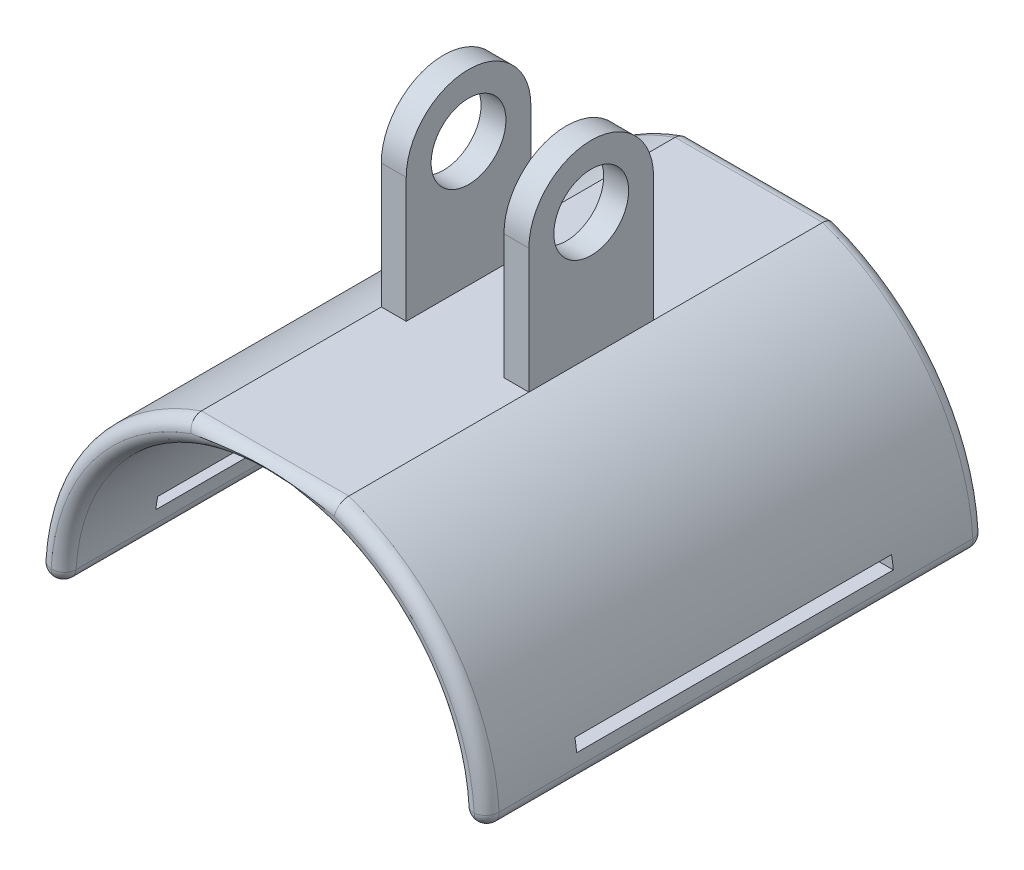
ISO-10303-21;
HEADER;
FILE_DESCRIPTION(('STEP AP214'),'2;1');
FILE_NAME('part.step','',(''),(''),'','','');
FILE_SCHEMA(('AUTOMOTIVE_DESIGN { 1 0 10303 214 1 1 1 1 }'));
ENDSEC;
DATA;
#1=APPLICATION_CONTEXT('core data for automotive mechanical design processes');
#2=APPLICATION_PROTOCOL_DEFINITION('international standard','automotive_design',2000,#1);
#3=PRODUCT_CONTEXT('',#1,'mechanical');
#4=PRODUCT('Part','Part','',(#3));
#5=PRODUCT_RELATED_PRODUCT_CATEGORY('part','',(#4));
#6=PRODUCT_DEFINITION_FORMATION('','',#4);
#7=PRODUCT_DEFINITION_CONTEXT('part definition',#1,'design');
#8=PRODUCT_DEFINITION('design','',#6,#7);
#9=PRODUCT_DEFINITION_SHAPE('','',#8);
#10=(LENGTH_UNIT() NAMED_UNIT(*) SI_UNIT(.MILLI.,.METRE.));
#11=(NAMED_UNIT(*) PLANE_ANGLE_UNIT() SI_UNIT($,.RADIAN.));
#12=(NAMED_UNIT(*) SI_UNIT($,.STERADIAN.) SOLID_ANGLE_UNIT());
#13=UNCERTAINTY_MEASURE_WITH_UNIT(LENGTH_MEASURE(1.E-05),#10,'distance_accuracy_value','');
#14=(GEOMETRIC_REPRESENTATION_CONTEXT(3) GLOBAL_UNCERTAINTY_ASSIGNED_CONTEXT((#13)) GLOBAL_UNIT_ASSIGNED_CONTEXT((#10,
#11,#12)) REPRESENTATION_CONTEXT('',''));
#15=CARTESIAN_POINT('',(0.,0.,0.));
#16=DIRECTION('',(0.,0.,1.));
#17=DIRECTION('',(1.,0.,0.));
#18=AXIS2_PLACEMENT_3D('',#15,#16,#17);
#19=CARTESIAN_POINT('',(0.,0.,20.));
#20=DIRECTION('',(0.,0.,-1.));
#21=DIRECTION('',(-1.,0.,0.));
#22=AXIS2_PLACEMENT_3D('',#19,#20,#21);
#23=CYLINDRICAL_SURFACE('',#22,9.);
#24=DIRECTION('',(0.,0.,-1.));
#25=VECTOR('',#24,1.);
#26=CARTESIAN_POINT('',(-2.95803989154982,8.49999999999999,20.));
#27=LINE('',#26,#25);
#28=CARTESIAN_POINT('',(-2.95803989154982,8.49999999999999,19.5));
#29=VERTEX_POINT('',#28);
#30=CARTESIAN_POINT('',(-2.95803989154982,8.49999999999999,12.2825689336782));
#31=VERTEX_POINT('',#30);
#32=EDGE_CURVE('E374',#29,#31,#27,.T.);
#33=ORIENTED_EDGE('',*,*,#32,.T.);
#34=CARTESIAN_POINT('',(-2.95803989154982,8.49999999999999,7.2825689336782));
#35=VERTEX_POINT('',#34);
#36=EDGE_CURVE('E379',#31,#35,#27,.T.);
#37=ORIENTED_EDGE('',*,*,#36,.T.);
#38=CARTESIAN_POINT('',(-2.95803989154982,8.49999999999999,0.5));
#39=VERTEX_POINT('',#38);
#40=EDGE_CURVE('E77',#35,#39,#27,.T.);
#41=ORIENTED_EDGE('',*,*,#40,.T.);
#42=CARTESIAN_POINT('',(0.,0.,0.5));
#43=DIRECTION('',(0.,0.,1.));
#44=DIRECTION('',(1.,0.,0.));
#45=AXIS2_PLACEMENT_3D('',#42,#43,#44);
#46=CIRCLE('',#45,9.);
#47=CARTESIAN_POINT('',(-8.98441557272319,0.529411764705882,0.5));
#48=VERTEX_POINT('',#47);
#49=EDGE_CURVE('E11',#39,#48,#46,.T.);
#50=ORIENTED_EDGE('',*,*,#49,.T.);
#51=DIRECTION('',(0.,0.,-1.));
#52=VECTOR('',#51,1.);
#53=CARTESIAN_POINT('',(-8.98441557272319,0.529411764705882,20.));
#54=LINE('',#53,#52);
#55=CARTESIAN_POINT('',(-8.98441557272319,0.529411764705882,19.5));
#56=VERTEX_POINT('',#55);
#57=EDGE_CURVE('E481',#48,#56,#54,.F.);
#58=ORIENTED_EDGE('',*,*,#57,.T.);
#59=CARTESIAN_POINT('',(0.,0.,19.5));
#60=DIRECTION('',(0.,0.,1.));
#61=DIRECTION('',(1.,0.,0.));
#62=AXIS2_PLACEMENT_3D('',#59,#60,#61);
#63=CIRCLE('',#62,9.);
#64=EDGE_CURVE('E63',#56,#29,#63,.F.);
#65=ORIENTED_EDGE('',*,*,#64,.T.);
#66=EDGE_LOOP('',(#33,#37,#41,#50,#58,#65));
#67=FACE_BOUND('',#66,.T.);
#68=CARTESIAN_POINT('',(0.,0.,16.35));
#69=DIRECTION('',(0.,0.,-1.));
#70=DIRECTION('',(-1.,0.,0.));
#71=AXIS2_PLACEMENT_3D('',#68,#69,#70);
#72=CIRCLE('',#71,9.);
#73=CARTESIAN_POINT('',(-8.87411967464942,1.5,16.35));
#74=VERTEX_POINT('',#73);
#75=CARTESIAN_POINT('',(-8.94427190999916,0.999999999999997,16.35));
#76=VERTEX_POINT('',#75);
#77=EDGE_CURVE('E396',#74,#76,#72,.F.);
#78=ORIENTED_EDGE('',*,*,#77,.T.);
#79=DIRECTION('',(0.,0.,-1.));
#80=VECTOR('',#79,1.);
#81=CARTESIAN_POINT('',(-8.94427190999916,0.999999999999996,20.));
#82=LINE('',#81,#80);
#83=CARTESIAN_POINT('',(-8.94427190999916,0.999999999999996,3.65));
#84=VERTEX_POINT('',#83);
#85=EDGE_CURVE('E406',#76,#84,#82,.T.);
#86=ORIENTED_EDGE('',*,*,#85,.T.);
#87=CARTESIAN_POINT('',(0.,0.,3.65000000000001));
#88=DIRECTION('',(0.,0.,-1.));
#89=DIRECTION('',(0.,1.,0.));
#90=AXIS2_PLACEMENT_3D('',#87,#88,#89);
#91=CIRCLE('',#90,9.);
#92=CARTESIAN_POINT('',(-8.87411967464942,1.5,3.65));
#93=VERTEX_POINT('',#92);
#94=EDGE_CURVE('E401',#93,#84,#91,.F.);
#95=ORIENTED_EDGE('',*,*,#94,.F.);
#96=DIRECTION('',(0.,0.,-1.));
#97=VECTOR('',#96,1.);
#98=CARTESIAN_POINT('',(-8.87411967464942,1.5,20.));
#99=LINE('',#98,#97);
#100=EDGE_CURVE('E389',#74,#93,#99,.T.);
#101=ORIENTED_EDGE('',*,*,#100,.F.);
#102=EDGE_LOOP('',(#78,#86,#95,#101));
#103=FACE_BOUND('',#102,.T.);
#104=ADVANCED_FACE('F47',(#67,#103),#23,.T.);
#105=DIRECTION('',(0.,0.,-1.));
#106=VECTOR('',#105,1.);
#107=CARTESIAN_POINT('',(8.98441557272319,0.529411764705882,20.));
#108=LINE('',#107,#106);
#109=CARTESIAN_POINT('',(8.98441557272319,0.529411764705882,19.5));
#110=VERTEX_POINT('',#109);
#111=CARTESIAN_POINT('',(8.98441557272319,0.529411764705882,0.5));
#112=VERTEX_POINT('',#111);
#113=EDGE_CURVE('E464',#110,#112,#108,.T.);
#114=ORIENTED_EDGE('',*,*,#113,.T.);
#115=CARTESIAN_POINT('',(0.,0.,0.5));
#116=DIRECTION('',(0.,0.,1.));
#117=DIRECTION('',(1.,0.,0.));
#118=AXIS2_PLACEMENT_3D('',#115,#116,#117);
#119=CIRCLE('',#118,9.);
#120=CARTESIAN_POINT('',(2.95803989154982,8.49999999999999,0.5));
#121=VERTEX_POINT('',#120);
#122=EDGE_CURVE('E470',#112,#121,#119,.T.);
#123=ORIENTED_EDGE('',*,*,#122,.T.);
#124=DIRECTION('',(0.,0.,-1.));
#125=VECTOR('',#124,1.);
#126=CARTESIAN_POINT('',(2.95803989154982,8.49999999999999,20.));
#127=LINE('',#126,#125);
#128=CARTESIAN_POINT('',(2.95803989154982,8.49999999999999,7.2825689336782));
#129=VERTEX_POINT('',#128);
#130=EDGE_CURVE('E368',#121,#129,#127,.F.);
#131=ORIENTED_EDGE('',*,*,#130,.T.);
#132=CARTESIAN_POINT('',(2.95803989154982,8.49999999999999,12.2825689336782));
#133=VERTEX_POINT('',#132);
#134=EDGE_CURVE('E372',#129,#133,#127,.F.);
#135=ORIENTED_EDGE('',*,*,#134,.T.);
#136=CARTESIAN_POINT('',(2.95803989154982,8.49999999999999,19.5));
#137=VERTEX_POINT('',#136);
#138=EDGE_CURVE('E373',#133,#137,#127,.F.);
#139=ORIENTED_EDGE('',*,*,#138,.T.);
#140=CARTESIAN_POINT('',(0.,0.,19.5));
#141=DIRECTION('',(0.,0.,1.));
#142=DIRECTION('',(1.,0.,0.));
#143=AXIS2_PLACEMENT_3D('',#140,#141,#142);
#144=CIRCLE('',#143,9.);
#145=EDGE_CURVE('E467',#137,#110,#144,.F.);
#146=ORIENTED_EDGE('',*,*,#145,.T.);
#147=EDGE_LOOP('',(#114,#123,#131,#135,#139,#146));
#148=FACE_BOUND('',#147,.T.);
#149=CARTESIAN_POINT('',(0.,0.,16.35));
#150=DIRECTION('',(0.,0.,1.));
#151=DIRECTION('',(1.,0.,0.));
#152=AXIS2_PLACEMENT_3D('',#149,#150,#151);
#153=CIRCLE('',#152,9.);
#154=CARTESIAN_POINT('',(8.87411967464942,1.5,16.35));
#155=VERTEX_POINT('',#154);
#156=CARTESIAN_POINT('',(8.94427190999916,0.999999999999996,16.35));
#157=VERTEX_POINT('',#156);
#158=EDGE_CURVE('E378',#155,#157,#153,.F.);
#159=ORIENTED_EDGE('',*,*,#158,.F.);
#160=DIRECTION('',(0.,0.,-1.));
#161=VECTOR('',#160,1.);
#162=CARTESIAN_POINT('',(8.87411967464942,1.5,20.));
#163=LINE('',#162,#161);
#164=CARTESIAN_POINT('',(8.87411967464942,1.5,3.65));
#165=VERTEX_POINT('',#164);
#166=EDGE_CURVE('E384',#155,#165,#163,.T.);
#167=ORIENTED_EDGE('',*,*,#166,.T.);
#168=CARTESIAN_POINT('',(0.,0.,3.65000000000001));
#169=DIRECTION('',(0.,0.,1.));
#170=DIRECTION('',(0.,-1.,0.));
#171=AXIS2_PLACEMENT_3D('',#168,#169,#170);
#172=CIRCLE('',#171,9.);
#173=CARTESIAN_POINT('',(8.94427190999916,0.999999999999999,3.65));
#174=VERTEX_POINT('',#173);
#175=EDGE_CURVE('E380',#165,#174,#172,.F.);
#176=ORIENTED_EDGE('',*,*,#175,.T.);
#177=DIRECTION('',(0.,0.,-1.));
#178=VECTOR('',#177,1.);
#179=CARTESIAN_POINT('',(8.94427190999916,0.999999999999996,20.));
#180=LINE('',#179,#178);
#181=EDGE_CURVE('E385',#157,#174,#180,.T.);
#182=ORIENTED_EDGE('',*,*,#181,.F.);
#183=EDGE_LOOP('',(#159,#167,#176,#182));
#184=FACE_BOUND('',#183,.T.);
#185=ADVANCED_FACE('F625',(#148,#184),#23,.T.);
#186=CARTESIAN_POINT('',(0.,0.,42.6274169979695));
#187=DIRECTION('',(0.,0.,-1.));
#188=DIRECTION('',(-1.,0.,0.));
#189=AXIS2_PLACEMENT_3D('',#186,#187,#188);
#190=CYLINDRICAL_SURFACE('',#189,8.);
#191=CARTESIAN_POINT('',(0.,0.,19.5));
#192=DIRECTION('',(0.,0.,1.));
#193=DIRECTION('',(1.,0.,0.));
#194=AXIS2_PLACEMENT_3D('',#191,#192,#193);
#195=CIRCLE('',#194,8.);
#196=CARTESIAN_POINT('',(7.98614717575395,0.470588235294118,19.5));
#197=VERTEX_POINT('',#196);
#198=CARTESIAN_POINT('',(-7.98614717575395,0.470588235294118,19.5));
#199=VERTEX_POINT('',#198);
#200=EDGE_CURVE('E454',#197,#199,#195,.T.);
#201=ORIENTED_EDGE('',*,*,#200,.T.);
#202=DIRECTION('',(0.,0.,-1.));
#203=VECTOR('',#202,1.);
#204=CARTESIAN_POINT('',(-7.98614717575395,0.470588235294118,42.6274169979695));
#205=LINE('',#204,#203);
#206=CARTESIAN_POINT('',(-7.98614717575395,0.470588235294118,0.5));
#207=VERTEX_POINT('',#206);
#208=EDGE_CURVE('E461',#199,#207,#205,.T.);
#209=ORIENTED_EDGE('',*,*,#208,.T.);
#210=CARTESIAN_POINT('',(0.,0.,0.5));
#211=DIRECTION('',(0.,0.,1.));
#212=DIRECTION('',(1.,0.,0.));
#213=AXIS2_PLACEMENT_3D('',#210,#211,#212);
#214=CIRCLE('',#213,8.);
#215=CARTESIAN_POINT('',(7.98614717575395,0.470588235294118,0.5));
#216=VERTEX_POINT('',#215);
#217=EDGE_CURVE('E457',#207,#216,#214,.F.);
#218=ORIENTED_EDGE('',*,*,#217,.T.);
#219=DIRECTION('',(0.,0.,-1.));
#220=VECTOR('',#219,1.);
#221=CARTESIAN_POINT('',(7.98614717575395,0.470588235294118,42.6274169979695));
#222=LINE('',#221,#220);
#223=EDGE_CURVE('E451',#216,#197,#222,.F.);
#224=ORIENTED_EDGE('',*,*,#223,.T.);
#225=EDGE_LOOP('',(#201,#209,#218,#224));
#226=FACE_BOUND('',#225,.T.);
#227=CARTESIAN_POINT('',(0.,0.,16.35));
#228=DIRECTION('',(0.,0.,-1.));
#229=DIRECTION('',(-1.,0.,0.));
#230=AXIS2_PLACEMENT_3D('',#227,#228,#229);
#231=CIRCLE('',#230,8.);
#232=CARTESIAN_POINT('',(-7.85811682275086,1.5,16.35));
#233=VERTEX_POINT('',#232);
#234=CARTESIAN_POINT('',(-7.93725393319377,0.999999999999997,16.35));
#235=VERTEX_POINT('',#234);
#236=EDGE_CURVE('E440',#233,#235,#231,.F.);
#237=ORIENTED_EDGE('',*,*,#236,.F.);
#238=DIRECTION('',(0.,0.,-1.));
#239=VECTOR('',#238,1.);
#240=CARTESIAN_POINT('',(-7.85811682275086,1.49999999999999,42.6274169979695));
#241=LINE('',#240,#239);
#242=CARTESIAN_POINT('',(-7.85811682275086,1.49999999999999,3.65));
#243=VERTEX_POINT('',#242);
#244=EDGE_CURVE('E428',#233,#243,#241,.T.);
#245=ORIENTED_EDGE('',*,*,#244,.T.);
#246=CARTESIAN_POINT('',(0.,0.,3.65000000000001));
#247=DIRECTION('',(0.,0.,-1.));
#248=DIRECTION('',(0.,1.,0.));
#249=AXIS2_PLACEMENT_3D('',#246,#247,#248);
#250=CIRCLE('',#249,8.);
#251=CARTESIAN_POINT('',(-7.93725393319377,0.999999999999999,3.65));
#252=VERTEX_POINT('',#251);
#253=EDGE_CURVE('E432',#243,#252,#250,.F.);
#254=ORIENTED_EDGE('',*,*,#253,.T.);
#255=DIRECTION('',(0.,0.,-1.));
#256=VECTOR('',#255,1.);
#257=CARTESIAN_POINT('',(-7.93725393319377,0.999999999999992,42.6274169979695));
#258=LINE('',#257,#256);
#259=EDGE_CURVE('E436',#235,#252,#258,.T.);
#260=ORIENTED_EDGE('',*,*,#259,.F.);
#261=EDGE_LOOP('',(#237,#245,#254,#260));
#262=FACE_BOUND('',#261,.T.);
#263=CARTESIAN_POINT('',(7.93725393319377,0.999999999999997,16.35));
#264=VERTEX_POINT('',#263);
#265=CARTESIAN_POINT('',(7.85811682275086,1.49999999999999,16.35));
#266=VERTEX_POINT('',#265);
#267=EDGE_CURVE('E444',#264,#266,#231,.F.);
#268=ORIENTED_EDGE('',*,*,#267,.F.);
#269=DIRECTION('',(0.,0.,-1.));
#270=VECTOR('',#269,1.);
#271=CARTESIAN_POINT('',(7.93725393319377,0.999999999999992,42.6274169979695));
#272=LINE('',#271,#270);
#273=CARTESIAN_POINT('',(7.93725393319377,0.999999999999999,3.65));
#274=VERTEX_POINT('',#273);
#275=EDGE_CURVE('E448',#274,#264,#272,.F.);
#276=ORIENTED_EDGE('',*,*,#275,.F.);
#277=CARTESIAN_POINT('',(7.85811682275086,1.5,3.65));
#278=VERTEX_POINT('',#277);
#279=EDGE_CURVE('E437',#274,#278,#250,.F.);
#280=ORIENTED_EDGE('',*,*,#279,.T.);
#281=DIRECTION('',(0.,0.,-1.));
#282=VECTOR('',#281,1.);
#283=CARTESIAN_POINT('',(7.85811682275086,1.49999999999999,42.6274169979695));
#284=LINE('',#283,#282);
#285=EDGE_CURVE('E443',#278,#266,#284,.F.);
#286=ORIENTED_EDGE('',*,*,#285,.T.);
#287=EDGE_LOOP('',(#268,#276,#280,#286));
#288=FACE_BOUND('',#287,.T.);
#289=ADVANCED_FACE('F632',(#226,#262,#288),#190,.F.);
#290=CARTESIAN_POINT('',(-9.001,1.5,3.65));
#291=DIRECTION('',(0.,1.,0.));
#292=DIRECTION('',(0.,0.,1.));
#293=AXIS2_PLACEMENT_3D('',#290,#291,#292);
#294=PLANE('',#293);
#295=DIRECTION('',(1.,0.,0.));
#296=VECTOR('',#295,1.);
#297=CARTESIAN_POINT('',(-9.001,1.5,16.35));
#298=LINE('',#297,#296);
#299=EDGE_CURVE('E424',#74,#233,#298,.T.);
#300=ORIENTED_EDGE('',*,*,#299,.F.);
#301=ORIENTED_EDGE('',*,*,#100,.T.);
#302=DIRECTION('',(1.,0.,0.));
#303=VECTOR('',#302,1.);
#304=CARTESIAN_POINT('',(-9.001,1.5,3.65));
#305=LINE('',#304,#303);
#306=EDGE_CURVE('E412',#93,#243,#305,.T.);
#307=ORIENTED_EDGE('',*,*,#306,.T.);
#308=ORIENTED_EDGE('',*,*,#244,.F.);
#309=EDGE_LOOP('',(#300,#301,#307,#308));
#310=FACE_BOUND('',#309,.T.);
#311=ADVANCED_FACE('F638',(#310),#294,.F.);
#312=CARTESIAN_POINT('',(-9.001,0.999999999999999,3.65));
#313=DIRECTION('',(0.,0.,-1.));
#314=DIRECTION('',(0.,1.,0.));
#315=AXIS2_PLACEMENT_3D('',#312,#313,#314);
#316=PLANE('',#315);
#317=ORIENTED_EDGE('',*,*,#306,.F.);
#318=ORIENTED_EDGE('',*,*,#94,.T.);
#319=DIRECTION('',(1.,0.,0.));
#320=VECTOR('',#319,1.);
#321=CARTESIAN_POINT('',(-9.001,0.999999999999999,3.65));
#322=LINE('',#321,#320);
#323=EDGE_CURVE('E417',#84,#252,#322,.T.);
#324=ORIENTED_EDGE('',*,*,#323,.T.);
#325=ORIENTED_EDGE('',*,*,#253,.F.);
#326=EDGE_LOOP('',(#317,#318,#324,#325));
#327=FACE_BOUND('',#326,.T.);
#328=ADVANCED_FACE('F651',(#327),#316,.F.);
#329=CARTESIAN_POINT('',(-9.001,0.999999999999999,3.65));
#330=DIRECTION('',(0.,1.,0.));
#331=DIRECTION('',(0.,0.,1.));
#332=AXIS2_PLACEMENT_3D('',#329,#330,#331);
#333=PLANE('',#332);
#334=ORIENTED_EDGE('',*,*,#259,.T.);
#335=ORIENTED_EDGE('',*,*,#323,.F.);
#336=ORIENTED_EDGE('',*,*,#85,.F.);
#337=DIRECTION('',(1.,0.,0.));
#338=VECTOR('',#337,1.);
#339=CARTESIAN_POINT('',(-9.001,0.999999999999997,16.35));
#340=LINE('',#339,#338);
#341=EDGE_CURVE('E411',#76,#235,#340,.T.);
#342=ORIENTED_EDGE('',*,*,#341,.T.);
#343=EDGE_LOOP('',(#334,#335,#336,#342));
#344=FACE_BOUND('',#343,.T.);
#345=ADVANCED_FACE('F650',(#344),#333,.T.);
#346=CARTESIAN_POINT('',(-9.001,0.999999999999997,16.35));
#347=DIRECTION('',(0.,0.,-1.));
#348=DIRECTION('',(-1.,0.,0.));
#349=AXIS2_PLACEMENT_3D('',#346,#347,#348);
#350=PLANE('',#349);
#351=ORIENTED_EDGE('',*,*,#236,.T.);
#352=ORIENTED_EDGE('',*,*,#341,.F.);
#353=ORIENTED_EDGE('',*,*,#77,.F.);
#354=ORIENTED_EDGE('',*,*,#299,.T.);
#355=EDGE_LOOP('',(#351,#352,#353,#354));
#356=FACE_BOUND('',#355,.T.);
#357=ADVANCED_FACE('F644',(#356),#350,.T.);
#358=ORIENTED_EDGE('',*,*,#267,.T.);
#359=EDGE_CURVE('E415',#266,#155,#298,.T.);
#360=ORIENTED_EDGE('',*,*,#359,.T.);
#361=ORIENTED_EDGE('',*,*,#158,.T.);
#362=EDGE_CURVE('E400',#264,#157,#340,.T.);
#363=ORIENTED_EDGE('',*,*,#362,.F.);
#364=EDGE_LOOP('',(#358,#360,#361,#363));
#365=FACE_BOUND('',#364,.T.);
#366=ADVANCED_FACE('F640',(#365),#350,.T.);
#367=ORIENTED_EDGE('',*,*,#275,.T.);
#368=ORIENTED_EDGE('',*,*,#362,.T.);
#369=ORIENTED_EDGE('',*,*,#181,.T.);
#370=EDGE_CURVE('E410',#274,#174,#322,.T.);
#371=ORIENTED_EDGE('',*,*,#370,.F.);
#372=EDGE_LOOP('',(#367,#368,#369,#371));
#373=FACE_BOUND('',#372,.T.);
#374=ADVANCED_FACE('F643',(#373),#333,.T.);
#375=ORIENTED_EDGE('',*,*,#370,.T.);
#376=ORIENTED_EDGE('',*,*,#175,.F.);
#377=EDGE_CURVE('E416',#278,#165,#305,.T.);
#378=ORIENTED_EDGE('',*,*,#377,.F.);
#379=ORIENTED_EDGE('',*,*,#279,.F.);
#380=EDGE_LOOP('',(#375,#376,#378,#379));
#381=FACE_BOUND('',#380,.T.);
#382=ADVANCED_FACE('F648',(#381),#316,.F.);
#383=ORIENTED_EDGE('',*,*,#377,.T.);
#384=ORIENTED_EDGE('',*,*,#166,.F.);
#385=ORIENTED_EDGE('',*,*,#359,.F.);
#386=ORIENTED_EDGE('',*,*,#285,.F.);
#387=EDGE_LOOP('',(#383,#384,#385,#386));
#388=FACE_BOUND('',#387,.T.);
#389=ADVANCED_FACE('F655',(#388),#294,.F.);
#390=CARTESIAN_POINT('',(5.,8.5,-10.0498756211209));
#391=DIRECTION('',(0.,-1.,0.));
#392=DIRECTION('',(1.,0.,0.));
#393=AXIS2_PLACEMENT_3D('',#390,#391,#392);
#394=PLANE('',#393);
#395=DIRECTION('',(0.,0.,-1.));
#396=VECTOR('',#395,1.);
#397=CARTESIAN_POINT('',(-1.96,8.49999999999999,0.));
#398=LINE('',#397,#396);
#399=CARTESIAN_POINT('',(-1.96,8.5,12.2825689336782));
#400=VERTEX_POINT('',#399);
#401=CARTESIAN_POINT('',(-1.96,8.49999999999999,7.2825689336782));
#402=VERTEX_POINT('',#401);
#403=EDGE_CURVE('E71',#400,#402,#398,.T.);
#404=ORIENTED_EDGE('',*,*,#403,.F.);
#405=DIRECTION('',(-1.,0.,0.));
#406=VECTOR('',#405,1.);
#407=CARTESIAN_POINT('',(-1.96,8.49999999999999,12.2825689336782));
#408=LINE('',#407,#406);
#409=EDGE_CURVE('E308',#400,#31,#408,.T.);
#410=ORIENTED_EDGE('',*,*,#409,.T.);
#411=ORIENTED_EDGE('',*,*,#32,.F.);
#412=DIRECTION('',(1.,0.,0.));
#413=VECTOR('',#412,1.);
#414=CARTESIAN_POINT('',(2.95803989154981,8.5,19.5));
#415=LINE('',#414,#413);
#416=EDGE_CURVE('E474',#29,#137,#415,.T.);
#417=ORIENTED_EDGE('',*,*,#416,.T.);
#418=ORIENTED_EDGE('',*,*,#138,.F.);
#419=DIRECTION('',(1.,0.,0.));
#420=VECTOR('',#419,1.);
#421=CARTESIAN_POINT('',(1.96,8.49999999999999,12.2825689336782));
#422=LINE('',#421,#420);
#423=CARTESIAN_POINT('',(1.96,8.49999999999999,12.2825689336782));
#424=VERTEX_POINT('',#423);
#425=EDGE_CURVE('E361',#424,#133,#422,.T.);
#426=ORIENTED_EDGE('',*,*,#425,.F.);
#427=DIRECTION('',(0.,0.,-1.));
#428=VECTOR('',#427,1.);
#429=CARTESIAN_POINT('',(1.96,8.49999999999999,0.));
#430=LINE('',#429,#428);
#431=CARTESIAN_POINT('',(1.96,8.5,7.2825689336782));
#432=VERTEX_POINT('',#431);
#433=EDGE_CURVE('E323',#424,#432,#430,.T.);
#434=ORIENTED_EDGE('',*,*,#433,.T.);
#435=DIRECTION('',(1.,0.,0.));
#436=VECTOR('',#435,1.);
#437=CARTESIAN_POINT('',(1.96,8.49999999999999,7.2825689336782));
#438=LINE('',#437,#436);
#439=EDGE_CURVE('E357',#432,#129,#438,.T.);
#440=ORIENTED_EDGE('',*,*,#439,.T.);
#441=ORIENTED_EDGE('',*,*,#130,.F.);
#442=DIRECTION('',(1.,0.,0.));
#443=VECTOR('',#442,1.);
#444=CARTESIAN_POINT('',(5.,8.5,0.5));
#445=LINE('',#444,#443);
#446=EDGE_CURVE('E478',#121,#39,#445,.F.);
#447=ORIENTED_EDGE('',*,*,#446,.T.);
#448=ORIENTED_EDGE('',*,*,#40,.F.);
#449=DIRECTION('',(-1.,0.,0.));
#450=VECTOR('',#449,1.);
#451=CARTESIAN_POINT('',(-1.96,8.49999999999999,7.2825689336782));
#452=LINE('',#451,#450);
#453=EDGE_CURVE('E312',#402,#35,#452,.T.);
#454=ORIENTED_EDGE('',*,*,#453,.F.);
#455=EDGE_LOOP('',(#404,#410,#411,#417,#418,#426,#434,#440,#441,#447,#448,#454));
#456=FACE_BOUND('',#455,.T.);
#457=ADVANCED_FACE('F658',(#456),#394,.F.);
#458=CARTESIAN_POINT('',(0.,0.,19.5));
#459=DIRECTION('',(0.,0.,1.));
#460=DIRECTION('',(1.,0.,0.));
#461=AXIS2_PLACEMENT_3D('',#458,#459,#460);
#462=TOROIDAL_SURFACE('',#461,8.5,0.5);
#463=CARTESIAN_POINT('',(-2.95803989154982,8.49999999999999,19.5));
#464=CARTESIAN_POINT('',(-2.95804383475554,8.50002517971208,19.5278411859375));
#465=CARTESIAN_POINT('',(-2.95764708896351,8.49767617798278,19.5556729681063));
#466=CARTESIAN_POINT('',(-2.95608170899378,8.48841796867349,19.6105147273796));
#467=CARTESIAN_POINT('',(-2.95491393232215,8.48151382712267,19.6375255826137));
#468=CARTESIAN_POINT('',(-2.95183533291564,8.46332961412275,19.6899967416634));
#469=CARTESIAN_POINT('',(-2.94992425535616,8.45204804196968,19.7154565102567));
#470=CARTESIAN_POINT('',(-2.94541419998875,8.42545970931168,19.7641059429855));
#471=CARTESIAN_POINT('',(-2.9428153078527,8.41015345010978,19.7872958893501));
#472=CARTESIAN_POINT('',(-2.93698335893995,8.37586273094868,19.8309100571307));
#473=CARTESIAN_POINT('',(-2.93374661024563,8.35685686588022,19.8513169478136));
#474=CARTESIAN_POINT('',(-2.92673628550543,8.31577301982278,19.888662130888));
#475=CARTESIAN_POINT('',(-2.9229625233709,8.29369397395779,19.9055992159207));
#476=CARTESIAN_POINT('',(-2.91492674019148,8.2467815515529,19.9357606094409));
#477=CARTESIAN_POINT('',(-2.9106588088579,8.22191497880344,19.948931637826));
#478=CARTESIAN_POINT('',(-2.90179356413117,8.17038631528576,19.9709051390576));
#479=CARTESIAN_POINT('',(-2.89719646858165,8.14372541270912,19.97971047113));
#480=CARTESIAN_POINT('',(-2.88941131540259,8.0986881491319,19.9905091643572));
#481=CARTESIAN_POINT('',(-2.88627982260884,8.08060120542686,19.9938026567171));
#482=CARTESIAN_POINT('',(-2.87996746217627,8.04420266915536,19.99837877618));
#483=CARTESIAN_POINT('',(-2.87678668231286,8.02589148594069,19.9996646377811));
#484=CARTESIAN_POINT('',(-2.87316080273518,8.00505280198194,19.9999808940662));
#485=CARTESIAN_POINT('',(-2.87272108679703,8.00252624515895,20.0000000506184));
#486=CARTESIAN_POINT('',(-2.87228132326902,8.,20.));
#487=B_SPLINE_CURVE_WITH_KNOTS('',3,(#463,#464,#465,#466,#467,#468,#469,#470,#471,#472,#473,
#474,#475,#476,#477,#478,#479,#480,#481,#482,#483,#484,#485,#486),.UNSPECIFIED.,.F.,.F.,(4,2,2,
2,2,2,2,2,2,2,2,4),(0.,0.0834079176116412,0.16672322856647,0.250067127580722,0.333400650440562,
0.417231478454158,0.501091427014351,0.586084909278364,0.671022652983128,0.72687447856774,
0.782636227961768,0.790329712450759),.UNSPECIFIED.);
#488=CARTESIAN_POINT('',(-2.87228132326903,8.,20.));
#489=VERTEX_POINT('',#488);
#490=EDGE_CURVE('E52',#29,#489,#487,.T.);
#491=ORIENTED_EDGE('',*,*,#490,.F.);
#492=ORIENTED_EDGE('',*,*,#64,.F.);
#493=CARTESIAN_POINT('',(-8.48528137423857,0.5,19.5));
#494=DIRECTION('',(-0.0588235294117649,-0.998268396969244,0.));
#495=DIRECTION('',(0.998268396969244,-0.0588235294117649,0.));
#496=AXIS2_PLACEMENT_3D('',#493,#494,#495);
#497=CIRCLE('',#496,0.5);
#498=CARTESIAN_POINT('',(-8.48528137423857,0.5,20.));
#499=VERTEX_POINT('',#498);
#500=EDGE_CURVE('E610',#499,#56,#497,.T.);
#501=ORIENTED_EDGE('',*,*,#500,.F.);
#502=CARTESIAN_POINT('',(0.,0.,20.));
#503=DIRECTION('',(0.,0.,1.));
#504=DIRECTION('',(1.,0.,0.));
#505=AXIS2_PLACEMENT_3D('',#502,#503,#504);
#506=CIRCLE('',#505,8.5);
#507=EDGE_CURVE('E1067',#489,#499,#506,.T.);
#508=ORIENTED_EDGE('',*,*,#507,.F.);
#509=EDGE_LOOP('',(#491,#492,#501,#508));
#510=FACE_BOUND('',#509,.T.);
#511=ADVANCED_FACE('F49',(#510),#462,.T.);
#512=CARTESIAN_POINT('',(5.,8.,19.5));
#513=DIRECTION('',(-1.,0.,0.));
#514=DIRECTION('',(0.,-1.,0.));
#515=AXIS2_PLACEMENT_3D('',#512,#513,#514);
#516=CYLINDRICAL_SURFACE('',#515,0.5);
#517=CARTESIAN_POINT('',(2.95803989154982,8.49999999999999,19.5));
#518=CARTESIAN_POINT('',(2.95804383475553,8.50002517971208,19.5278411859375));
#519=CARTESIAN_POINT('',(2.9576470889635,8.49767617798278,19.5556729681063));
#520=CARTESIAN_POINT('',(2.95608170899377,8.4884179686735,19.6105147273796));
#521=CARTESIAN_POINT('',(2.95491393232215,8.48151382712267,19.6375255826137));
#522=CARTESIAN_POINT('',(2.95183533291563,8.46332961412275,19.6899967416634));
#523=CARTESIAN_POINT('',(2.94992425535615,8.45204804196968,19.7154565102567));
#524=CARTESIAN_POINT('',(2.94541419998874,8.42545970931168,19.7641059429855));
#525=CARTESIAN_POINT('',(2.94281530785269,8.41015345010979,19.7872958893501));
#526=CARTESIAN_POINT('',(2.93698335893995,8.37586273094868,19.8309100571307));
#527=CARTESIAN_POINT('',(2.93374661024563,8.35685686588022,19.8513169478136));
#528=CARTESIAN_POINT('',(2.92673628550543,8.31577301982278,19.888662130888));
#529=CARTESIAN_POINT('',(2.9229625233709,8.29369397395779,19.9055992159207));
#530=CARTESIAN_POINT('',(2.91492674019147,8.2467815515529,19.9357606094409));
#531=CARTESIAN_POINT('',(2.91065880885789,8.22191497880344,19.948931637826));
#532=CARTESIAN_POINT('',(2.90179356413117,8.17038631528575,19.9709051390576));
#533=CARTESIAN_POINT('',(2.89719646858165,8.14372541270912,19.97971047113));
#534=CARTESIAN_POINT('',(2.88941131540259,8.0986881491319,19.9905091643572));
#535=CARTESIAN_POINT('',(2.88627982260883,8.08060120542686,19.9938026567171));
#536=CARTESIAN_POINT('',(2.87996746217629,8.04420266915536,19.99837877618));
#537=CARTESIAN_POINT('',(2.87678668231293,8.02589148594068,19.9996646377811));
#538=CARTESIAN_POINT('',(2.87316080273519,8.00505280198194,19.9999808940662));
#539=CARTESIAN_POINT('',(2.87272108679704,8.00252624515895,20.0000000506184));
#540=CARTESIAN_POINT('',(2.87228132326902,8.,20.));
#541=B_SPLINE_CURVE_WITH_KNOTS('',3,(#517,#518,#519,#520,#521,#522,#523,#524,#525,#526,#527,
#528,#529,#530,#531,#532,#533,#534,#535,#536,#537,#538,#539,#540),.UNSPECIFIED.,.F.,.F.,(4,2,2,
2,2,2,2,2,2,2,2,4),(0.,0.0834079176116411,0.16672322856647,0.250067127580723,0.333400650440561,
0.417231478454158,0.501091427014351,0.586084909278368,0.67102265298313,0.726874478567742,
0.782636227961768,0.790329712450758),.UNSPECIFIED.);
#542=CARTESIAN_POINT('',(2.87228132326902,8.,20.));
#543=VERTEX_POINT('',#542);
#544=EDGE_CURVE('E603',#137,#543,#541,.T.);
#545=ORIENTED_EDGE('',*,*,#544,.F.);
#546=ORIENTED_EDGE('',*,*,#416,.F.);
#547=ORIENTED_EDGE('',*,*,#490,.T.);
#548=CARTESIAN_POINT('',(-2.87228132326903,8.,20.));
#549=CARTESIAN_POINT('',(-2.86975489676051,8.00043979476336,19.9999999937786));
#550=CARTESIAN_POINT('',(-2.86722836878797,8.00087902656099,19.9999994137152));
#551=CARTESIAN_POINT('',(-2.70040819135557,8.02984203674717,19.9999234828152));
#552=CARTESIAN_POINT('',(-2.53568759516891,8.05598522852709,19.9974387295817));
#553=CARTESIAN_POINT('',(-2.28811430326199,8.09155611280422,19.9916914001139));
#554=CARTESIAN_POINT('',(-2.20548598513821,8.10280823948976,19.989438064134));
#555=CARTESIAN_POINT('',(-2.04007483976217,8.12408893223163,19.9844806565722));
#556=CARTESIAN_POINT('',(-1.95729199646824,8.1341173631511,19.9817765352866));
#557=CARTESIAN_POINT('',(-1.70711702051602,8.16253780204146,19.97326114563));
#558=CARTESIAN_POINT('',(-1.53951826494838,8.1790317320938,19.9670930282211));
#559=CARTESIAN_POINT('',(-1.20387375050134,8.20693493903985,19.9554196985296));
#560=CARTESIAN_POINT('',(-1.03582798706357,8.21834416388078,19.9499144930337));
#561=CARTESIAN_POINT('',(-0.699395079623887,8.23603463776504,19.9408940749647));
#562=CARTESIAN_POINT('',(-0.531007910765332,8.2423154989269,19.9373790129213));
#563=CARTESIAN_POINT('',(-0.194091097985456,8.24971831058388,19.9331970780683));
#564=CARTESIAN_POINT('',(-0.025561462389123,8.25084054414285,19.9325300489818));
#565=CARTESIAN_POINT('',(0.311420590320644,8.24792134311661,19.9342090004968));
#566=CARTESIAN_POINT('',(0.47987301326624,8.24388040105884,19.9365546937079));
#567=CARTESIAN_POINT('',(0.816531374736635,8.23065498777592,19.9436817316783));
#568=CARTESIAN_POINT('',(0.98473729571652,8.22147016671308,19.9484632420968));
#569=CARTESIAN_POINT('',(1.3207255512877,8.19799712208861,19.9593072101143));
#570=CARTESIAN_POINT('',(1.48850793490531,8.18370951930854,19.9653695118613));
#571=CARTESIAN_POINT('',(1.82357141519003,8.15008033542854,19.9772780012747));
#572=CARTESIAN_POINT('',(1.99085253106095,8.13073895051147,19.98312419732));
#573=CARTESIAN_POINT('',(2.21691574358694,8.10117504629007,19.9897202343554));
#574=CARTESIAN_POINT('',(2.27596328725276,8.09313554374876,19.9913222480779));
#575=CARTESIAN_POINT('',(2.39397359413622,8.07643550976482,19.9941957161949));
#576=CARTESIAN_POINT('',(2.45293636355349,8.06777502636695,19.9954671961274));
#577=CARTESIAN_POINT('',(2.62965537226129,8.04087233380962,19.9986545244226));
#578=CARTESIAN_POINT('',(2.74728695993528,8.02170303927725,19.9999446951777));
#579=CARTESIAN_POINT('',(2.86722836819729,8.00087902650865,19.9999994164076));
#580=CARTESIAN_POINT('',(2.86975489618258,8.00043979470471,19.9999999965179));
#581=CARTESIAN_POINT('',(2.87228132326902,8.,20.));
#582=B_SPLINE_CURVE_WITH_KNOTS('',3,(#548,#549,#550,#551,#552,#553,#554,#555,#556,#557,#558,
#559,#560,#561,#562,#563,#564,#565,#566,#567,#568,#569,#570,#571,#572,#573,#574,#575,#576,#577,
#578,#579,#580,#581),.UNSPECIFIED.,.F.,.F.,(4,2,2,2,2,2,2,2,2,2,2,2,2,2,2,2,4),(0.,
0.00769327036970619,0.507946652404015,0.758205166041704,1.00849129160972,1.51397294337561,
2.01945976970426,2.52498482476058,3.03048214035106,3.53593123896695,4.04141471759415,
4.54683672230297,5.05223910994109,5.23107722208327,5.40990151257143,5.76741496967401,
5.7751082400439),.UNSPECIFIED.);
#583=EDGE_CURVE('E596',#543,#489,#582,.F.);
#584=ORIENTED_EDGE('',*,*,#583,.F.);
#585=EDGE_LOOP('',(#545,#546,#547,#584));
#586=FACE_BOUND('',#585,.T.);
#587=ADVANCED_FACE('F585',(#586),#516,.T.);
#588=CARTESIAN_POINT('',(0.,0.,19.5));
#589=DIRECTION('',(0.,0.,1.));
#590=DIRECTION('',(1.,0.,0.));
#591=AXIS2_PLACEMENT_3D('',#588,#589,#590);
#592=TOROIDAL_SURFACE('',#591,8.5,0.5);
#593=ORIENTED_EDGE('',*,*,#145,.F.);
#594=ORIENTED_EDGE('',*,*,#544,.T.);
#595=CARTESIAN_POINT('',(0.,0.,20.));
#596=DIRECTION('',(0.,0.,1.));
#597=DIRECTION('',(1.,0.,0.));
#598=AXIS2_PLACEMENT_3D('',#595,#596,#597);
#599=CIRCLE('',#598,8.5);
#600=CARTESIAN_POINT('',(8.48528137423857,0.5,20.));
#601=VERTEX_POINT('',#600);
#602=EDGE_CURVE('E1072',#601,#543,#599,.T.);
#603=ORIENTED_EDGE('',*,*,#602,.F.);
#604=CARTESIAN_POINT('',(8.48528137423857,0.5,19.5));
#605=DIRECTION('',(0.0588235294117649,-0.998268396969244,0.));
#606=DIRECTION('',(0.998268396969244,0.0588235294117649,0.));
#607=AXIS2_PLACEMENT_3D('',#604,#605,#606);
#608=CIRCLE('',#607,0.5);
#609=EDGE_CURVE('E1075',#110,#601,#608,.T.);
#610=ORIENTED_EDGE('',*,*,#609,.F.);
#611=EDGE_LOOP('',(#593,#594,#603,#610));
#612=FACE_BOUND('',#611,.T.);
#613=ADVANCED_FACE('F589',(#612),#592,.T.);
#614=CARTESIAN_POINT('',(-8.48528137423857,0.5,19.5));
#615=DIRECTION('',(0.,0.,1.));
#616=DIRECTION('',(1.,0.,0.));
#617=AXIS2_PLACEMENT_3D('',#614,#615,#616);
#618=SPHERICAL_SURFACE('',#617,0.5);
#619=CARTESIAN_POINT('',(-8.48528137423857,0.5,19.5));
#620=DIRECTION('',(-1.,0.,0.));
#621=DIRECTION('',(0.,0.,1.));
#622=AXIS2_PLACEMENT_3D('',#619,#620,#621);
#623=CIRCLE('',#622,0.5);
#624=CARTESIAN_POINT('',(-8.48528137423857,0.,19.5));
#625=VERTEX_POINT('',#624);
#626=EDGE_CURVE('E1064',#499,#625,#623,.F.);
#627=ORIENTED_EDGE('',*,*,#626,.F.);
#628=ORIENTED_EDGE('',*,*,#500,.T.);
#629=CARTESIAN_POINT('',(-8.48528137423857,0.5,19.5));
#630=DIRECTION('',(0.,0.,1.));
#631=DIRECTION('',(1.,0.,0.));
#632=AXIS2_PLACEMENT_3D('',#629,#630,#631);
#633=CIRCLE('',#632,0.5);
#634=EDGE_CURVE('E1078',#625,#56,#633,.F.);
#635=ORIENTED_EDGE('',*,*,#634,.F.);
#636=EDGE_LOOP('',(#627,#628,#635));
#637=FACE_BOUND('',#636,.T.);
#638=ADVANCED_FACE('F615',(#637),#618,.T.);
#639=CARTESIAN_POINT('',(0.,0.,19.5));
#640=DIRECTION('',(0.,0.,1.));
#641=DIRECTION('',(1.,0.,0.));
#642=AXIS2_PLACEMENT_3D('',#639,#640,#641);
#643=TOROIDAL_SURFACE('',#642,8.5,0.5);
#644=CARTESIAN_POINT('',(8.48528137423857,0.5,19.5));
#645=DIRECTION('',(0.0588235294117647,-0.998268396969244,0.));
#646=DIRECTION('',(0.998268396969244,0.0588235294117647,0.));
#647=AXIS2_PLACEMENT_3D('',#644,#645,#646);
#648=CIRCLE('',#647,0.5);
#649=EDGE_CURVE('E1086',#601,#197,#648,.T.);
#650=ORIENTED_EDGE('',*,*,#649,.F.);
#651=ORIENTED_EDGE('',*,*,#602,.T.);
#652=ORIENTED_EDGE('',*,*,#583,.T.);
#653=ORIENTED_EDGE('',*,*,#507,.T.);
#654=CARTESIAN_POINT('',(-8.48528137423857,0.5,19.5));
#655=DIRECTION('',(-0.0588235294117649,-0.998268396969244,0.));
#656=DIRECTION('',(0.998268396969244,-0.0588235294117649,0.));
#657=AXIS2_PLACEMENT_3D('',#654,#655,#656);
#658=CIRCLE('',#657,0.5);
#659=EDGE_CURVE('E1082',#199,#499,#658,.T.);
#660=ORIENTED_EDGE('',*,*,#659,.F.);
#661=ORIENTED_EDGE('',*,*,#200,.F.);
#662=EDGE_LOOP('',(#650,#651,#652,#653,#660,#661));
#663=FACE_BOUND('',#662,.T.);
#664=ADVANCED_FACE('F583',(#663),#643,.T.);
#665=CARTESIAN_POINT('',(8.48528137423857,0.5,19.5));
#666=DIRECTION('',(0.,0.,1.));
#667=DIRECTION('',(1.,0.,0.));
#668=AXIS2_PLACEMENT_3D('',#665,#666,#667);
#669=SPHERICAL_SURFACE('',#668,0.5);
#670=ORIENTED_EDGE('',*,*,#609,.T.);
#671=CARTESIAN_POINT('',(8.48528137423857,0.5,19.5));
#672=DIRECTION('',(-1.,0.,0.));
#673=DIRECTION('',(0.,0.,1.));
#674=AXIS2_PLACEMENT_3D('',#671,#672,#673);
#675=CIRCLE('',#674,0.5);
#676=CARTESIAN_POINT('',(8.48528137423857,0.,19.5));
#677=VERTEX_POINT('',#676);
#678=EDGE_CURVE('E1090',#677,#601,#675,.T.);
#679=ORIENTED_EDGE('',*,*,#678,.F.);
#680=CARTESIAN_POINT('',(8.48528137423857,0.5,19.5));
#681=DIRECTION('',(0.,0.,1.));
#682=DIRECTION('',(1.,0.,0.));
#683=AXIS2_PLACEMENT_3D('',#680,#681,#682);
#684=CIRCLE('',#683,0.5);
#685=EDGE_CURVE('E1094',#110,#677,#684,.F.);
#686=ORIENTED_EDGE('',*,*,#685,.F.);
#687=EDGE_LOOP('',(#670,#679,#686));
#688=FACE_BOUND('',#687,.T.);
#689=ADVANCED_FACE('F580',(#688),#669,.T.);
#690=CARTESIAN_POINT('',(-8.48528137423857,0.5,20.));
#691=DIRECTION('',(0.,0.,-1.));
#692=DIRECTION('',(-1.,0.,0.));
#693=AXIS2_PLACEMENT_3D('',#690,#691,#692);
#694=CYLINDRICAL_SURFACE('',#693,0.5);
#695=ORIENTED_EDGE('',*,*,#634,.T.);
#696=ORIENTED_EDGE('',*,*,#57,.F.);
#697=CARTESIAN_POINT('',(-8.48528137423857,0.5,0.5));
#698=DIRECTION('',(0.,0.,-1.));
#699=DIRECTION('',(-1.,0.,0.));
#700=AXIS2_PLACEMENT_3D('',#697,#698,#699);
#701=CIRCLE('',#700,0.5);
#702=CARTESIAN_POINT('',(-8.48528137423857,0.,0.5));
#703=VERTEX_POINT('',#702);
#704=EDGE_CURVE('E1101',#703,#48,#701,.T.);
#705=ORIENTED_EDGE('',*,*,#704,.F.);
#706=DIRECTION('',(0.,0.,-1.));
#707=VECTOR('',#706,1.);
#708=CARTESIAN_POINT('',(-8.48528137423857,0.,20.));
#709=LINE('',#708,#707);
#710=EDGE_CURVE('E1109',#625,#703,#709,.T.);
#711=ORIENTED_EDGE('',*,*,#710,.F.);
#712=EDGE_LOOP('',(#695,#696,#705,#711));
#713=FACE_BOUND('',#712,.T.);
#714=ADVANCED_FACE('F576',(#713),#694,.T.);
#715=CARTESIAN_POINT('',(-8.48528137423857,0.5,19.5));
#716=DIRECTION('',(0.,0.,1.));
#717=DIRECTION('',(1.,0.,0.));
#718=AXIS2_PLACEMENT_3D('',#715,#716,#717);
#719=SPHERICAL_SURFACE('',#718,0.5);
#720=ORIENTED_EDGE('',*,*,#659,.T.);
#721=ORIENTED_EDGE('',*,*,#626,.T.);
#722=CARTESIAN_POINT('',(-8.48528137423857,0.5,19.5));
#723=DIRECTION('',(0.,0.,1.));
#724=DIRECTION('',(1.,0.,0.));
#725=AXIS2_PLACEMENT_3D('',#722,#723,#724);
#726=CIRCLE('',#725,0.5);
#727=EDGE_CURVE('E1113',#199,#625,#726,.F.);
#728=ORIENTED_EDGE('',*,*,#727,.F.);
#729=EDGE_LOOP('',(#720,#721,#728));
#730=FACE_BOUND('',#729,.T.);
#731=ADVANCED_FACE('F572',(#730),#719,.T.);
#732=CARTESIAN_POINT('',(8.48528137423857,0.5,19.5));
#733=DIRECTION('',(0.,0.,1.));
#734=DIRECTION('',(1.,0.,0.));
#735=AXIS2_PLACEMENT_3D('',#732,#733,#734);
#736=SPHERICAL_SURFACE('',#735,0.5);
#737=ORIENTED_EDGE('',*,*,#678,.T.);
#738=ORIENTED_EDGE('',*,*,#649,.T.);
#739=CARTESIAN_POINT('',(8.48528137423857,0.5,19.5));
#740=DIRECTION('',(0.,0.,1.));
#741=DIRECTION('',(1.,0.,0.));
#742=AXIS2_PLACEMENT_3D('',#739,#740,#741);
#743=CIRCLE('',#742,0.5);
#744=EDGE_CURVE('E1117',#677,#197,#743,.F.);
#745=ORIENTED_EDGE('',*,*,#744,.F.);
#746=EDGE_LOOP('',(#737,#738,#745));
#747=FACE_BOUND('',#746,.T.);
#748=ADVANCED_FACE('F568',(#747),#736,.T.);
#749=CARTESIAN_POINT('',(8.48528137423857,0.5,20.));
#750=DIRECTION('',(0.,0.,-1.));
#751=DIRECTION('',(-1.,0.,0.));
#752=AXIS2_PLACEMENT_3D('',#749,#750,#751);
#753=CYLINDRICAL_SURFACE('',#752,0.5);
#754=CARTESIAN_POINT('',(8.48528137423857,0.5,0.5));
#755=DIRECTION('',(0.,0.,-1.));
#756=DIRECTION('',(-1.,0.,0.));
#757=AXIS2_PLACEMENT_3D('',#754,#755,#756);
#758=CIRCLE('',#757,0.5);
#759=CARTESIAN_POINT('',(8.48528137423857,0.,0.5));
#760=VERTEX_POINT('',#759);
#761=EDGE_CURVE('E1098',#112,#760,#758,.T.);
#762=ORIENTED_EDGE('',*,*,#761,.F.);
#763=ORIENTED_EDGE('',*,*,#113,.F.);
#764=ORIENTED_EDGE('',*,*,#685,.T.);
#765=DIRECTION('',(0.,0.,-1.));
#766=VECTOR('',#765,1.);
#767=CARTESIAN_POINT('',(8.48528137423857,0.,20.));
#768=LINE('',#767,#766);
#769=EDGE_CURVE('E1121',#760,#677,#768,.F.);
#770=ORIENTED_EDGE('',*,*,#769,.F.);
#771=EDGE_LOOP('',(#762,#763,#764,#770));
#772=FACE_BOUND('',#771,.T.);
#773=ADVANCED_FACE('F564',(#772),#753,.T.);
#774=CARTESIAN_POINT('',(8.48528137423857,0.5,0.5));
#775=DIRECTION('',(0.,0.,-1.));
#776=DIRECTION('',(-1.,0.,0.));
#777=AXIS2_PLACEMENT_3D('',#774,#775,#776);
#778=SPHERICAL_SURFACE('',#777,0.5);
#779=CARTESIAN_POINT('',(8.48528137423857,0.5,0.5));
#780=DIRECTION('',(0.0588235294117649,-0.998268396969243,0.));
#781=DIRECTION('',(0.998268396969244,0.0588235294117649,0.));
#782=AXIS2_PLACEMENT_3D('',#779,#780,#781);
#783=CIRCLE('',#782,0.5);
#784=CARTESIAN_POINT('',(8.48528137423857,0.5,0.));
#785=VERTEX_POINT('',#784);
#786=EDGE_CURVE('E1129',#112,#785,#783,.F.);
#787=ORIENTED_EDGE('',*,*,#786,.F.);
#788=ORIENTED_EDGE('',*,*,#761,.T.);
#789=CARTESIAN_POINT('',(8.48528137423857,0.5,0.5));
#790=DIRECTION('',(1.,0.,0.));
#791=DIRECTION('',(0.,0.,-1.));
#792=AXIS2_PLACEMENT_3D('',#789,#790,#791);
#793=CIRCLE('',#792,0.5);
#794=EDGE_CURVE('E1125',#785,#760,#793,.F.);
#795=ORIENTED_EDGE('',*,*,#794,.F.);
#796=EDGE_LOOP('',(#787,#788,#795));
#797=FACE_BOUND('',#796,.T.);
#798=ADVANCED_FACE('F560',(#797),#778,.T.);
#799=CARTESIAN_POINT('',(-8.48528137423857,0.5,0.5));
#800=DIRECTION('',(0.,0.,-1.));
#801=DIRECTION('',(-1.,0.,0.));
#802=AXIS2_PLACEMENT_3D('',#799,#800,#801);
#803=SPHERICAL_SURFACE('',#802,0.5);
#804=CARTESIAN_POINT('',(-8.48528137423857,0.5,0.5));
#805=DIRECTION('',(-1.,0.,0.));
#806=DIRECTION('',(0.,0.,1.));
#807=AXIS2_PLACEMENT_3D('',#804,#805,#806);
#808=CIRCLE('',#807,0.5);
#809=CARTESIAN_POINT('',(-8.48528137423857,0.5,0.));
#810=VERTEX_POINT('',#809);
#811=EDGE_CURVE('E1105',#703,#810,#808,.F.);
#812=ORIENTED_EDGE('',*,*,#811,.F.);
#813=ORIENTED_EDGE('',*,*,#704,.T.);
#814=CARTESIAN_POINT('',(-8.48528137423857,0.5,0.5));
#815=DIRECTION('',(-0.0588235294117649,-0.998268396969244,0.));
#816=DIRECTION('',(0.998268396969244,-0.0588235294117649,0.));
#817=AXIS2_PLACEMENT_3D('',#814,#815,#816);
#818=CIRCLE('',#817,0.5);
#819=EDGE_CURVE('E532',#810,#48,#818,.F.);
#820=ORIENTED_EDGE('',*,*,#819,.F.);
#821=EDGE_LOOP('',(#812,#813,#820));
#822=FACE_BOUND('',#821,.T.);
#823=ADVANCED_FACE('F556',(#822),#803,.T.);
#824=CARTESIAN_POINT('',(-8.48528137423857,0.5,42.6274169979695));
#825=DIRECTION('',(0.,0.,-1.));
#826=DIRECTION('',(-1.,0.,0.));
#827=AXIS2_PLACEMENT_3D('',#824,#825,#826);
#828=CYLINDRICAL_SURFACE('',#827,0.5);
#829=ORIENTED_EDGE('',*,*,#727,.T.);
#830=ORIENTED_EDGE('',*,*,#710,.T.);
#831=CARTESIAN_POINT('',(-8.48528137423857,0.5,0.5));
#832=DIRECTION('',(0.,0.,-1.));
#833=DIRECTION('',(-1.,0.,0.));
#834=AXIS2_PLACEMENT_3D('',#831,#832,#833);
#835=CIRCLE('',#834,0.5);
#836=EDGE_CURVE('E1136',#207,#703,#835,.T.);
#837=ORIENTED_EDGE('',*,*,#836,.F.);
#838=ORIENTED_EDGE('',*,*,#208,.F.);
#839=EDGE_LOOP('',(#829,#830,#837,#838));
#840=FACE_BOUND('',#839,.T.);
#841=ADVANCED_FACE('F552',(#840),#828,.T.);
#842=CARTESIAN_POINT('',(8.48528137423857,0.5,42.6274169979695));
#843=DIRECTION('',(0.,0.,-1.));
#844=DIRECTION('',(-1.,0.,0.));
#845=AXIS2_PLACEMENT_3D('',#842,#843,#844);
#846=CYLINDRICAL_SURFACE('',#845,0.5);
#847=ORIENTED_EDGE('',*,*,#744,.T.);
#848=ORIENTED_EDGE('',*,*,#223,.F.);
#849=CARTESIAN_POINT('',(8.48528137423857,0.5,0.5));
#850=DIRECTION('',(0.,0.,-1.));
#851=DIRECTION('',(-1.,0.,0.));
#852=AXIS2_PLACEMENT_3D('',#849,#850,#851);
#853=CIRCLE('',#852,0.5);
#854=EDGE_CURVE('E1139',#760,#216,#853,.T.);
#855=ORIENTED_EDGE('',*,*,#854,.F.);
#856=ORIENTED_EDGE('',*,*,#769,.T.);
#857=EDGE_LOOP('',(#847,#848,#855,#856));
#858=FACE_BOUND('',#857,.T.);
#859=ADVANCED_FACE('F548',(#858),#846,.T.);
#860=CARTESIAN_POINT('',(0.,0.,0.5));
#861=DIRECTION('',(0.,0.,1.));
#862=DIRECTION('',(1.,0.,0.));
#863=AXIS2_PLACEMENT_3D('',#860,#861,#862);
#864=TOROIDAL_SURFACE('',#863,8.5,0.5);
#865=CARTESIAN_POINT('',(2.95803989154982,8.49999999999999,0.5));
#866=CARTESIAN_POINT('',(2.95804383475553,8.50002517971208,0.47215881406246));
#867=CARTESIAN_POINT('',(2.9576470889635,8.49767617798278,0.444327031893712));
#868=CARTESIAN_POINT('',(2.95608170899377,8.4884179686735,0.389485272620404));
#869=CARTESIAN_POINT('',(2.95491393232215,8.48151382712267,0.362474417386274));
#870=CARTESIAN_POINT('',(2.95183533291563,8.46332961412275,0.310003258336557));
#871=CARTESIAN_POINT('',(2.94992425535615,8.45204804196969,0.284543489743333));
#872=CARTESIAN_POINT('',(2.94541419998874,8.42545970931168,0.235894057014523));
#873=CARTESIAN_POINT('',(2.94281530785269,8.41015345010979,0.212704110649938));
#874=CARTESIAN_POINT('',(2.93698335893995,8.37586273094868,0.169089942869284));
#875=CARTESIAN_POINT('',(2.93374661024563,8.35685686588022,0.14868305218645));
#876=CARTESIAN_POINT('',(2.92673628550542,8.31577301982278,0.111337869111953));
#877=CARTESIAN_POINT('',(2.9229625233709,8.29369397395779,0.0944007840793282));
#878=CARTESIAN_POINT('',(2.91492674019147,8.2467815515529,0.0642393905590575));
#879=CARTESIAN_POINT('',(2.9106588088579,8.22191497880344,0.0510683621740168));
#880=CARTESIAN_POINT('',(2.90179356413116,8.17038631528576,0.0290948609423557));
#881=CARTESIAN_POINT('',(2.89719646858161,8.14372541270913,0.0202895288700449));
#882=CARTESIAN_POINT('',(2.8894113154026,8.0986881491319,0.00949083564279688));
#883=CARTESIAN_POINT('',(2.88627982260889,8.08060120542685,0.0061973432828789));
#884=CARTESIAN_POINT('',(2.8799674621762,8.04420266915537,0.00162122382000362));
#885=CARTESIAN_POINT('',(2.87678668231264,8.02589148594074,0.000335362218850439));
#886=CARTESIAN_POINT('',(2.87316080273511,8.00505280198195,1.91059337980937E-05));
#887=CARTESIAN_POINT('',(2.87272108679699,8.00252624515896,-5.0618448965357E-08));
#888=CARTESIAN_POINT('',(2.87228132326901,8.,0.));
#889=B_SPLINE_CURVE_WITH_KNOTS('',3,(#865,#866,#867,#868,#869,#870,#871,#872,#873,#874,#875,
#876,#877,#878,#879,#880,#881,#882,#883,#884,#885,#886,#887,#888),.UNSPECIFIED.,.F.,.F.,(4,2,2,
2,2,2,2,2,2,2,2,4),(0.,0.08340791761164,0.166723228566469,0.250067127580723,0.333400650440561,
0.417231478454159,0.501091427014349,0.586084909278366,0.671022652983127,0.726874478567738,
0.782636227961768,0.790329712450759),.UNSPECIFIED.);
#890=CARTESIAN_POINT('',(2.87228132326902,8.,0.));
#891=VERTEX_POINT('',#890);
#892=EDGE_CURVE('E531',#121,#891,#889,.T.);
#893=ORIENTED_EDGE('',*,*,#892,.F.);
#894=ORIENTED_EDGE('',*,*,#122,.F.);
#895=ORIENTED_EDGE('',*,*,#786,.T.);
#896=CARTESIAN_POINT('',(0.,0.,0.));
#897=DIRECTION('',(0.,0.,1.));
#898=DIRECTION('',(1.,0.,0.));
#899=AXIS2_PLACEMENT_3D('',#896,#897,#898);
#900=CIRCLE('',#899,8.5);
#901=EDGE_CURVE('E506',#891,#785,#900,.F.);
#902=ORIENTED_EDGE('',*,*,#901,.F.);
#903=EDGE_LOOP('',(#893,#894,#895,#902));
#904=FACE_BOUND('',#903,.T.);
#905=ADVANCED_FACE('F515',(#904),#864,.T.);
#906=CARTESIAN_POINT('',(0.,8.,0.5));
#907=DIRECTION('',(1.,0.,0.));
#908=DIRECTION('',(0.,1.,0.));
#909=AXIS2_PLACEMENT_3D('',#906,#907,#908);
#910=CYLINDRICAL_SURFACE('',#909,0.5);
#911=CARTESIAN_POINT('',(-2.95803989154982,8.49999999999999,0.5));
#912=CARTESIAN_POINT('',(-2.95804383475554,8.50002517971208,0.47215881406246));
#913=CARTESIAN_POINT('',(-2.95764708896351,8.49767617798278,0.444327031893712));
#914=CARTESIAN_POINT('',(-2.95608170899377,8.48841796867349,0.389485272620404));
#915=CARTESIAN_POINT('',(-2.95491393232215,8.48151382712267,0.362474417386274));
#916=CARTESIAN_POINT('',(-2.95183533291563,8.46332961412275,0.310003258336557));
#917=CARTESIAN_POINT('',(-2.94992425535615,8.45204804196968,0.284543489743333));
#918=CARTESIAN_POINT('',(-2.94541419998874,8.42545970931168,0.235894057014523));
#919=CARTESIAN_POINT('',(-2.94281530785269,8.41015345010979,0.212704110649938));
#920=CARTESIAN_POINT('',(-2.93698335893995,8.37586273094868,0.169089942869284));
#921=CARTESIAN_POINT('',(-2.93374661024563,8.35685686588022,0.148683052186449));
#922=CARTESIAN_POINT('',(-2.92673628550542,8.31577301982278,0.111337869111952));
#923=CARTESIAN_POINT('',(-2.9229625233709,8.29369397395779,0.0944007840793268));
#924=CARTESIAN_POINT('',(-2.91492674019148,8.2467815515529,0.064239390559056));
#925=CARTESIAN_POINT('',(-2.9106588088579,8.22191497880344,0.0510683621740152));
#926=CARTESIAN_POINT('',(-2.90179356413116,8.17038631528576,0.0290948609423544));
#927=CARTESIAN_POINT('',(-2.89719646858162,8.14372541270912,0.0202895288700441));
#928=CARTESIAN_POINT('',(-2.88941131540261,8.0986881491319,0.00949083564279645));
#929=CARTESIAN_POINT('',(-2.88627982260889,8.08060120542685,0.00619734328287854));
#930=CARTESIAN_POINT('',(-2.87996746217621,8.04420266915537,0.00162122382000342));
#931=CARTESIAN_POINT('',(-2.87678668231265,8.02589148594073,0.000335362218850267));
#932=CARTESIAN_POINT('',(-2.87316080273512,8.00505280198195,1.91059337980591E-05));
#933=CARTESIAN_POINT('',(-2.872721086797,8.00252624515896,-5.06184489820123E-08));
#934=CARTESIAN_POINT('',(-2.87228132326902,8.,0.));
#935=B_SPLINE_CURVE_WITH_KNOTS('',3,(#911,#912,#913,#914,#915,#916,#917,#918,#919,#920,#921,
#922,#923,#924,#925,#926,#927,#928,#929,#930,#931,#932,#933,#934),.UNSPECIFIED.,.F.,.F.,(4,2,2,
2,2,2,2,2,2,2,2,4),(0.,0.0834079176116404,0.166723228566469,0.250067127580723,0.333400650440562,
0.41723147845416,0.501091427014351,0.586084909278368,0.67102265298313,0.726874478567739,
0.782636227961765,0.790329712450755),.UNSPECIFIED.);
#936=CARTESIAN_POINT('',(-2.87228132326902,8.,0.));
#937=VERTEX_POINT('',#936);
#938=EDGE_CURVE('E523',#39,#937,#935,.T.);
#939=ORIENTED_EDGE('',*,*,#938,.F.);
#940=ORIENTED_EDGE('',*,*,#446,.F.);
#941=ORIENTED_EDGE('',*,*,#892,.T.);
#942=CARTESIAN_POINT('',(-2.87228132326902,8.,0.));
#943=CARTESIAN_POINT('',(-2.86975489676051,8.00043979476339,6.22140863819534E-09));
#944=CARTESIAN_POINT('',(-2.86722836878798,8.00087902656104,5.86284809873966E-07));
#945=CARTESIAN_POINT('',(-2.70040819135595,8.02984203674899,7.65171847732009E-05));
#946=CARTESIAN_POINT('',(-2.5356875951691,8.05598522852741,0.00256127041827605));
#947=CARTESIAN_POINT('',(-2.28811430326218,8.09155611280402,0.00830859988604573));
#948=CARTESIAN_POINT('',(-2.20548598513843,8.10280823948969,0.0105619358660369));
#949=CARTESIAN_POINT('',(-2.04007483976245,8.12408893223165,0.0155193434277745));
#950=CARTESIAN_POINT('',(-1.95729199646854,8.13411736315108,0.0182234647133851));
#951=CARTESIAN_POINT('',(-1.70711702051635,8.1625378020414,0.0267388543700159));
#952=CARTESIAN_POINT('',(-1.53951826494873,8.17903173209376,0.0329069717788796));
#953=CARTESIAN_POINT('',(-1.20387375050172,8.20693493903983,0.0445803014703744));
#954=CARTESIAN_POINT('',(-1.03582798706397,8.21834416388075,0.0500855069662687));
#955=CARTESIAN_POINT('',(-0.699395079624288,8.23603463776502,0.0591059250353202));
#956=CARTESIAN_POINT('',(-0.531007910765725,8.24231549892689,0.0626209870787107));
#957=CARTESIAN_POINT('',(-0.19409109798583,8.24971831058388,0.0668029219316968));
#958=CARTESIAN_POINT('',(-0.0255614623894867,8.25084054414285,0.0674699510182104));
#959=CARTESIAN_POINT('',(0.311420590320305,8.24792134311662,0.0657909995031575));
#960=CARTESIAN_POINT('',(0.479873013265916,8.24388040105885,0.0634453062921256));
#961=CARTESIAN_POINT('',(0.816531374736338,8.23065498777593,0.0563182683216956));
#962=CARTESIAN_POINT('',(0.984737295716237,8.22147016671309,0.0515367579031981));
#963=CARTESIAN_POINT('',(1.32072555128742,8.19799712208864,0.0406927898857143));
#964=CARTESIAN_POINT('',(1.48850793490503,8.18370951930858,0.0346304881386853));
#965=CARTESIAN_POINT('',(1.82357141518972,8.15008033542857,0.0227219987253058));
#966=CARTESIAN_POINT('',(1.99085253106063,8.13073895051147,0.0168758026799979));
#967=CARTESIAN_POINT('',(2.21691574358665,8.10117504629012,0.010279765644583));
#968=CARTESIAN_POINT('',(2.2759632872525,8.09313554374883,0.00867775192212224));
#969=CARTESIAN_POINT('',(2.393973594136,8.07643550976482,0.00580428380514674));
#970=CARTESIAN_POINT('',(2.45293636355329,8.06777502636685,0.00453280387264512));
#971=CARTESIAN_POINT('',(2.62965537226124,8.0408723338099,0.00134547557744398));
#972=CARTESIAN_POINT('',(2.74728695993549,8.02170303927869,5.53048223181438E-05));
#973=CARTESIAN_POINT('',(2.8672283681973,8.00087902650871,5.83592402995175E-07));
#974=CARTESIAN_POINT('',(2.86975489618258,8.00043979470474,3.4820843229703E-09));
#975=CARTESIAN_POINT('',(2.87228132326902,8.,0.));
#976=B_SPLINE_CURVE_WITH_KNOTS('',3,(#942,#943,#944,#945,#946,#947,#948,#949,#950,#951,#952,
#953,#954,#955,#956,#957,#958,#959,#960,#961,#962,#963,#964,#965,#966,#967,#968,#969,#970,#971,
#972,#973,#974,#975),.UNSPECIFIED.,.F.,.F.,(4,2,2,2,2,2,2,2,2,2,2,2,2,2,2,2,4),(0.,
0.00769327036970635,0.507946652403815,0.758205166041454,1.00849129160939,1.51397294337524,
2.01945976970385,2.5249848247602,3.03048214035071,3.53593123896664,4.04141471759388,
4.54683672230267,5.05223910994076,5.23107722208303,5.40990151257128,5.76741496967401,
5.77510824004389),.UNSPECIFIED.);
#977=EDGE_CURVE('E496',#937,#891,#976,.T.);
#978=ORIENTED_EDGE('',*,*,#977,.F.);
#979=EDGE_LOOP('',(#939,#940,#941,#978));
#980=FACE_BOUND('',#979,.T.);
#981=ADVANCED_FACE('F510',(#980),#910,.T.);
#982=CARTESIAN_POINT('',(0.,0.,0.5));
#983=DIRECTION('',(0.,0.,1.));
#984=DIRECTION('',(1.,0.,0.));
#985=AXIS2_PLACEMENT_3D('',#982,#983,#984);
#986=TOROIDAL_SURFACE('',#985,8.5,0.5);
#987=ORIENTED_EDGE('',*,*,#49,.F.);
#988=ORIENTED_EDGE('',*,*,#938,.T.);
#989=CARTESIAN_POINT('',(0.,0.,0.));
#990=DIRECTION('',(0.,0.,1.));
#991=DIRECTION('',(1.,0.,0.));
#992=AXIS2_PLACEMENT_3D('',#989,#990,#991);
#993=CIRCLE('',#992,8.5);
#994=EDGE_CURVE('E492',#810,#937,#993,.F.);
#995=ORIENTED_EDGE('',*,*,#994,.F.);
#996=ORIENTED_EDGE('',*,*,#819,.T.);
#997=EDGE_LOOP('',(#987,#988,#995,#996));
#998=FACE_BOUND('',#997,.T.);
#999=ADVANCED_FACE('F514',(#998),#986,.T.);
#1000=CARTESIAN_POINT('',(-8.48528137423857,0.5,0.5));
#1001=DIRECTION('',(0.,0.,-1.));
#1002=DIRECTION('',(-1.,0.,0.));
#1003=AXIS2_PLACEMENT_3D('',#1000,#1001,#1002);
#1004=SPHERICAL_SURFACE('',#1003,0.5);
#1005=ORIENTED_EDGE('',*,*,#836,.T.);
#1006=ORIENTED_EDGE('',*,*,#811,.T.);
#1007=CARTESIAN_POINT('',(-8.48528137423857,0.5,0.5));
#1008=DIRECTION('',(-0.0588235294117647,-0.998268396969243,0.));
#1009=DIRECTION('',(0.998268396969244,-0.0588235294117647,0.));
#1010=AXIS2_PLACEMENT_3D('',#1007,#1008,#1009);
#1011=CIRCLE('',#1010,0.5);
#1012=EDGE_CURVE('E488',#207,#810,#1011,.F.);
#1013=ORIENTED_EDGE('',*,*,#1012,.F.);
#1014=EDGE_LOOP('',(#1005,#1006,#1013));
#1015=FACE_BOUND('',#1014,.T.);
#1016=ADVANCED_FACE('F543',(#1015),#1004,.T.);
#1017=CARTESIAN_POINT('',(8.48528137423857,0.5,0.5));
#1018=DIRECTION('',(0.,0.,-1.));
#1019=DIRECTION('',(-1.,0.,0.));
#1020=AXIS2_PLACEMENT_3D('',#1017,#1018,#1019);
#1021=SPHERICAL_SURFACE('',#1020,0.5);
#1022=ORIENTED_EDGE('',*,*,#794,.T.);
#1023=ORIENTED_EDGE('',*,*,#854,.T.);
#1024=CARTESIAN_POINT('',(8.48528137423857,0.5,0.5));
#1025=DIRECTION('',(0.0588235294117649,-0.998268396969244,0.));
#1026=DIRECTION('',(0.998268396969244,0.0588235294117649,0.));
#1027=AXIS2_PLACEMENT_3D('',#1024,#1025,#1026);
#1028=CIRCLE('',#1027,0.5);
#1029=EDGE_CURVE('E356',#785,#216,#1028,.F.);
#1030=ORIENTED_EDGE('',*,*,#1029,.F.);
#1031=EDGE_LOOP('',(#1022,#1023,#1030));
#1032=FACE_BOUND('',#1031,.T.);
#1033=ADVANCED_FACE('F839',(#1032),#1021,.T.);
#1034=CARTESIAN_POINT('',(0.,0.,0.5));
#1035=DIRECTION('',(0.,0.,1.));
#1036=DIRECTION('',(1.,0.,0.));
#1037=AXIS2_PLACEMENT_3D('',#1034,#1035,#1036);
#1038=TOROIDAL_SURFACE('',#1037,8.5,0.5);
#1039=ORIENTED_EDGE('',*,*,#977,.T.);
#1040=ORIENTED_EDGE('',*,*,#901,.T.);
#1041=ORIENTED_EDGE('',*,*,#1029,.T.);
#1042=ORIENTED_EDGE('',*,*,#217,.F.);
#1043=ORIENTED_EDGE('',*,*,#1012,.T.);
#1044=ORIENTED_EDGE('',*,*,#994,.T.);
#1045=EDGE_LOOP('',(#1039,#1040,#1041,#1042,#1043,#1044));
#1046=FACE_BOUND('',#1045,.T.);
#1047=ADVANCED_FACE('F517',(#1046),#1038,.T.);
#1048=CARTESIAN_POINT('',(1.96,8.49999999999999,0.));
#1049=DIRECTION('',(0.,-1.,0.));
#1050=DIRECTION('',(0.,0.,-1.));
#1051=AXIS2_PLACEMENT_3D('',#1048,#1049,#1050);
#1052=PLANE('',#1051);
#1053=ORIENTED_EDGE('',*,*,#134,.F.);
#1054=CARTESIAN_POINT('',(2.96,8.49999999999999,7.2825689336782));
#1055=VERTEX_POINT('',#1054);
#1056=EDGE_CURVE('E360',#129,#1055,#438,.T.);
#1057=ORIENTED_EDGE('',*,*,#1056,.T.);
#1058=DIRECTION('',(0.,0.,-1.));
#1059=VECTOR('',#1058,1.);
#1060=CARTESIAN_POINT('',(2.96,8.49999999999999,0.));
#1061=LINE('',#1060,#1059);
#1062=CARTESIAN_POINT('',(2.96,8.49999999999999,12.2825689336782));
#1063=VERTEX_POINT('',#1062);
#1064=EDGE_CURVE('E342',#1063,#1055,#1061,.T.);
#1065=ORIENTED_EDGE('',*,*,#1064,.F.);
#1066=EDGE_CURVE('E365',#133,#1063,#422,.T.);
#1067=ORIENTED_EDGE('',*,*,#1066,.F.);
#1068=EDGE_LOOP('',(#1053,#1057,#1065,#1067));
#1069=FACE_BOUND('',#1068,.T.);
#1070=ADVANCED_FACE('F666',(#1069),#1052,.T.);
#1071=CARTESIAN_POINT('',(1.96,13.5,9.7825689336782));
#1072=DIRECTION('',(1.,0.,0.));
#1073=DIRECTION('',(0.,0.,-1.));
#1074=AXIS2_PLACEMENT_3D('',#1071,#1072,#1073);
#1075=CYLINDRICAL_SURFACE('',#1074,2.5);
#1076=CARTESIAN_POINT('',(2.96,13.5,9.7825689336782));
#1077=DIRECTION('',(1.,0.,0.));
#1078=DIRECTION('',(0.,0.,-1.));
#1079=AXIS2_PLACEMENT_3D('',#1076,#1077,#1078);
#1080=CIRCLE('',#1079,2.5);
#1081=CARTESIAN_POINT('',(2.96,13.5,7.2825689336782));
#1082=VERTEX_POINT('',#1081);
#1083=CARTESIAN_POINT('',(2.96,13.5,12.2825689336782));
#1084=VERTEX_POINT('',#1083);
#1085=EDGE_CURVE('E307',#1082,#1084,#1080,.T.);
#1086=ORIENTED_EDGE('',*,*,#1085,.F.);
#1087=DIRECTION('',(1.,0.,0.));
#1088=VECTOR('',#1087,1.);
#1089=CARTESIAN_POINT('',(1.96,13.5,7.2825689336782));
#1090=LINE('',#1089,#1088);
#1091=CARTESIAN_POINT('',(1.96,13.5,7.2825689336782));
#1092=VERTEX_POINT('',#1091);
#1093=EDGE_CURVE('E353',#1092,#1082,#1090,.T.);
#1094=ORIENTED_EDGE('',*,*,#1093,.F.);
#1095=CARTESIAN_POINT('',(1.96,13.5,9.7825689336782));
#1096=DIRECTION('',(1.,0.,0.));
#1097=DIRECTION('',(0.,0.,-1.));
#1098=AXIS2_PLACEMENT_3D('',#1095,#1096,#1097);
#1099=CIRCLE('',#1098,2.5);
#1100=CARTESIAN_POINT('',(1.96,13.5,12.2825689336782));
#1101=VERTEX_POINT('',#1100);
#1102=EDGE_CURVE('E315',#1092,#1101,#1099,.T.);
#1103=ORIENTED_EDGE('',*,*,#1102,.T.);
#1104=DIRECTION('',(1.,0.,0.));
#1105=VECTOR('',#1104,1.);
#1106=CARTESIAN_POINT('',(1.96,13.5,12.2825689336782));
#1107=LINE('',#1106,#1105);
#1108=EDGE_CURVE('E334',#1101,#1084,#1107,.T.);
#1109=ORIENTED_EDGE('',*,*,#1108,.T.);
#1110=EDGE_LOOP('',(#1086,#1094,#1103,#1109));
#1111=FACE_BOUND('',#1110,.T.);
#1112=ADVANCED_FACE('F662',(#1111),#1075,.T.);
#1113=CARTESIAN_POINT('',(1.96,0.,7.2825689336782));
#1114=DIRECTION('',(0.,0.,-1.));
#1115=DIRECTION('',(-1.,0.,0.));
#1116=AXIS2_PLACEMENT_3D('',#1113,#1114,#1115);
#1117=PLANE('',#1116);
#1118=DIRECTION('',(0.,1.,0.));
#1119=VECTOR('',#1118,1.);
#1120=CARTESIAN_POINT('',(2.96,0.,7.2825689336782));
#1121=LINE('',#1120,#1119);
#1122=EDGE_CURVE('E346',#1055,#1082,#1121,.T.);
#1123=ORIENTED_EDGE('',*,*,#1122,.F.);
#1124=ORIENTED_EDGE('',*,*,#1056,.F.);
#1125=ORIENTED_EDGE('',*,*,#439,.F.);
#1126=DIRECTION('',(0.,1.,0.));
#1127=VECTOR('',#1126,1.);
#1128=CARTESIAN_POINT('',(1.96,0.,7.2825689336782));
#1129=LINE('',#1128,#1127);
#1130=EDGE_CURVE('E326',#432,#1092,#1129,.T.);
#1131=ORIENTED_EDGE('',*,*,#1130,.T.);
#1132=ORIENTED_EDGE('',*,*,#1093,.T.);
#1133=EDGE_LOOP('',(#1123,#1124,#1125,#1131,#1132));
#1134=FACE_BOUND('',#1133,.T.);
#1135=ADVANCED_FACE('F665',(#1134),#1117,.T.);
#1136=CARTESIAN_POINT('',(1.96,0.,12.2825689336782));
#1137=DIRECTION('',(0.,0.,-1.));
#1138=DIRECTION('',(-1.,0.,0.));
#1139=AXIS2_PLACEMENT_3D('',#1136,#1137,#1138);
#1140=PLANE('',#1139);
#1141=DIRECTION('',(0.,1.,0.));
#1142=VECTOR('',#1141,1.);
#1143=CARTESIAN_POINT('',(2.96,0.,12.2825689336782));
#1144=LINE('',#1143,#1142);
#1145=EDGE_CURVE('E338',#1063,#1084,#1144,.T.);
#1146=ORIENTED_EDGE('',*,*,#1145,.T.);
#1147=ORIENTED_EDGE('',*,*,#1108,.F.);
#1148=DIRECTION('',(0.,1.,0.));
#1149=VECTOR('',#1148,1.);
#1150=CARTESIAN_POINT('',(1.96,0.,12.2825689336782));
#1151=LINE('',#1150,#1149);
#1152=EDGE_CURVE('E319',#424,#1101,#1151,.T.);
#1153=ORIENTED_EDGE('',*,*,#1152,.F.);
#1154=ORIENTED_EDGE('',*,*,#425,.T.);
#1155=ORIENTED_EDGE('',*,*,#1066,.T.);
#1156=EDGE_LOOP('',(#1146,#1147,#1153,#1154,#1155));
#1157=FACE_BOUND('',#1156,.T.);
#1158=ADVANCED_FACE('F668',(#1157),#1140,.F.);
#1159=CARTESIAN_POINT('',(1.96,13.5,9.7825689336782));
#1160=DIRECTION('',(1.,0.,0.));
#1161=DIRECTION('',(0.,0.,-1.));
#1162=AXIS2_PLACEMENT_3D('',#1159,#1160,#1161);
#1163=CYLINDRICAL_SURFACE('',#1162,1.5);
#1164=CARTESIAN_POINT('',(1.96,13.5,9.7825689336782));
#1165=DIRECTION('',(1.,0.,0.));
#1166=DIRECTION('',(0.,0.,-1.));
#1167=AXIS2_PLACEMENT_3D('',#1164,#1165,#1166);
#1168=CIRCLE('',#1167,1.5);
#1169=CARTESIAN_POINT('',(1.96,13.5,8.2825689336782));
#1170=VERTEX_POINT('',#1169);
#1171=EDGE_CURVE('E330',#1170,#1170,#1168,.T.);
#1172=ORIENTED_EDGE('',*,*,#1171,.F.);
#1173=EDGE_LOOP('',(#1172));
#1174=FACE_BOUND('',#1173,.T.);
#1175=CARTESIAN_POINT('',(2.96,13.5,9.7825689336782));
#1176=DIRECTION('',(1.,0.,0.));
#1177=DIRECTION('',(0.,0.,-1.));
#1178=AXIS2_PLACEMENT_3D('',#1175,#1176,#1177);
#1179=CIRCLE('',#1178,1.5);
#1180=CARTESIAN_POINT('',(2.96,13.5,8.2825689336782));
#1181=VERTEX_POINT('',#1180);
#1182=EDGE_CURVE('E320',#1181,#1181,#1179,.T.);
#1183=ORIENTED_EDGE('',*,*,#1182,.T.);
#1184=EDGE_LOOP('',(#1183));
#1185=FACE_BOUND('',#1184,.T.);
#1186=ADVANCED_FACE('F671',(#1174,#1185),#1163,.F.);
#1187=CARTESIAN_POINT('',(1.96,0.,0.));
#1188=DIRECTION('',(1.,0.,0.));
#1189=DIRECTION('',(0.,0.,-1.));
#1190=AXIS2_PLACEMENT_3D('',#1187,#1188,#1189);
#1191=PLANE('',#1190);
#1192=ORIENTED_EDGE('',*,*,#1102,.F.);
#1193=ORIENTED_EDGE('',*,*,#1130,.F.);
#1194=ORIENTED_EDGE('',*,*,#433,.F.);
#1195=ORIENTED_EDGE('',*,*,#1152,.T.);
#1196=EDGE_LOOP('',(#1192,#1193,#1194,#1195));
#1197=FACE_BOUND('',#1196,.T.);
#1198=ORIENTED_EDGE('',*,*,#1171,.T.);
#1199=EDGE_LOOP('',(#1198));
#1200=FACE_BOUND('',#1199,.T.);
#1201=ADVANCED_FACE('F681',(#1197,#1200),#1191,.F.);
#1202=CARTESIAN_POINT('',(2.96,0.,0.));
#1203=DIRECTION('',(1.,0.,0.));
#1204=DIRECTION('',(0.,0.,-1.));
#1205=AXIS2_PLACEMENT_3D('',#1202,#1203,#1204);
#1206=PLANE('',#1205);
#1207=ORIENTED_EDGE('',*,*,#1085,.T.);
#1208=ORIENTED_EDGE('',*,*,#1145,.F.);
#1209=ORIENTED_EDGE('',*,*,#1064,.T.);
#1210=ORIENTED_EDGE('',*,*,#1122,.T.);
#1211=EDGE_LOOP('',(#1207,#1208,#1209,#1210));
#1212=FACE_BOUND('',#1211,.T.);
#1213=ORIENTED_EDGE('',*,*,#1182,.F.);
#1214=EDGE_LOOP('',(#1213));
#1215=FACE_BOUND('',#1214,.T.);
#1216=ADVANCED_FACE('F683',(#1212,#1215),#1206,.T.);
#1217=CARTESIAN_POINT('',(-1.96,8.49999999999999,0.));
#1218=DIRECTION('',(0.,1.,0.));
#1219=DIRECTION('',(0.,0.,1.));
#1220=AXIS2_PLACEMENT_3D('',#1217,#1218,#1219);
#1221=PLANE('',#1220);
#1222=CARTESIAN_POINT('',(-2.96,8.49999999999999,7.2825689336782));
#1223=VERTEX_POINT('',#1222);
#1224=EDGE_CURVE('E271',#35,#1223,#452,.T.);
#1225=ORIENTED_EDGE('',*,*,#1224,.F.);
#1226=ORIENTED_EDGE('',*,*,#36,.F.);
#1227=CARTESIAN_POINT('',(-2.96,8.49999999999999,12.2825689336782));
#1228=VERTEX_POINT('',#1227);
#1229=EDGE_CURVE('E311',#31,#1228,#408,.T.);
#1230=ORIENTED_EDGE('',*,*,#1229,.T.);
#1231=DIRECTION('',(0.,0.,-1.));
#1232=VECTOR('',#1231,1.);
#1233=CARTESIAN_POINT('',(-2.96,8.49999999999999,0.));
#1234=LINE('',#1233,#1232);
#1235=EDGE_CURVE('E298',#1228,#1223,#1234,.T.);
#1236=ORIENTED_EDGE('',*,*,#1235,.T.);
#1237=EDGE_LOOP('',(#1225,#1226,#1230,#1236));
#1238=FACE_BOUND('',#1237,.T.);
#1239=ADVANCED_FACE('F686',(#1238),#1221,.F.);
#1240=CARTESIAN_POINT('',(-1.96,13.5,9.7825689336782));
#1241=DIRECTION('',(-1.,0.,0.));
#1242=DIRECTION('',(0.,0.,1.));
#1243=AXIS2_PLACEMENT_3D('',#1240,#1241,#1242);
#1244=CYLINDRICAL_SURFACE('',#1243,2.5);
#1245=CARTESIAN_POINT('',(-2.96,13.5,9.7825689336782));
#1246=DIRECTION('',(1.,0.,0.));
#1247=DIRECTION('',(0.,0.,-1.));
#1248=AXIS2_PLACEMENT_3D('',#1245,#1246,#1247);
#1249=CIRCLE('',#1248,2.5);
#1250=CARTESIAN_POINT('',(-2.96,13.5,7.2825689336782));
#1251=VERTEX_POINT('',#1250);
#1252=CARTESIAN_POINT('',(-2.96,13.5,12.2825689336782));
#1253=VERTEX_POINT('',#1252);
#1254=EDGE_CURVE('E293',#1251,#1253,#1249,.T.);
#1255=ORIENTED_EDGE('',*,*,#1254,.T.);
#1256=DIRECTION('',(-1.,0.,0.));
#1257=VECTOR('',#1256,1.);
#1258=CARTESIAN_POINT('',(-1.96,13.5,12.2825689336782));
#1259=LINE('',#1258,#1257);
#1260=CARTESIAN_POINT('',(-1.96,13.5,12.2825689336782));
#1261=VERTEX_POINT('',#1260);
#1262=EDGE_CURVE('E275',#1261,#1253,#1259,.T.);
#1263=ORIENTED_EDGE('',*,*,#1262,.F.);
#1264=CARTESIAN_POINT('',(-1.96,13.5,9.7825689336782));
#1265=DIRECTION('',(1.,0.,0.));
#1266=DIRECTION('',(0.,0.,-1.));
#1267=AXIS2_PLACEMENT_3D('',#1264,#1265,#1266);
#1268=CIRCLE('',#1267,2.5);
#1269=CARTESIAN_POINT('',(-1.96,13.5,7.2825689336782));
#1270=VERTEX_POINT('',#1269);
#1271=EDGE_CURVE('E256',#1270,#1261,#1268,.T.);
#1272=ORIENTED_EDGE('',*,*,#1271,.F.);
#1273=DIRECTION('',(-1.,0.,0.));
#1274=VECTOR('',#1273,1.);
#1275=CARTESIAN_POINT('',(-1.96,13.5,7.2825689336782));
#1276=LINE('',#1275,#1274);
#1277=EDGE_CURVE('E263',#1270,#1251,#1276,.T.);
#1278=ORIENTED_EDGE('',*,*,#1277,.T.);
#1279=EDGE_LOOP('',(#1255,#1263,#1272,#1278));
#1280=FACE_BOUND('',#1279,.T.);
#1281=ADVANCED_FACE('F274',(#1280),#1244,.T.);
#1282=CARTESIAN_POINT('',(-1.96,0.,12.2825689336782));
#1283=DIRECTION('',(0.,0.,1.));
#1284=DIRECTION('',(1.,0.,0.));
#1285=AXIS2_PLACEMENT_3D('',#1282,#1283,#1284);
#1286=PLANE('',#1285);
#1287=DIRECTION('',(0.,1.,0.));
#1288=VECTOR('',#1287,1.);
#1289=CARTESIAN_POINT('',(-2.96,0.,12.2825689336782));
#1290=LINE('',#1289,#1288);
#1291=EDGE_CURVE('E282',#1228,#1253,#1290,.T.);
#1292=ORIENTED_EDGE('',*,*,#1291,.F.);
#1293=ORIENTED_EDGE('',*,*,#1229,.F.);
#1294=ORIENTED_EDGE('',*,*,#409,.F.);
#1295=DIRECTION('',(0.,1.,0.));
#1296=VECTOR('',#1295,1.);
#1297=CARTESIAN_POINT('',(-1.96,0.,12.2825689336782));
#1298=LINE('',#1297,#1296);
#1299=EDGE_CURVE('E287',#400,#1261,#1298,.T.);
#1300=ORIENTED_EDGE('',*,*,#1299,.T.);
#1301=ORIENTED_EDGE('',*,*,#1262,.T.);
#1302=EDGE_LOOP('',(#1292,#1293,#1294,#1300,#1301));
#1303=FACE_BOUND('',#1302,.T.);
#1304=ADVANCED_FACE('F693',(#1303),#1286,.T.);
#1305=CARTESIAN_POINT('',(-1.96,0.,7.2825689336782));
#1306=DIRECTION('',(0.,0.,1.));
#1307=DIRECTION('',(1.,0.,0.));
#1308=AXIS2_PLACEMENT_3D('',#1305,#1306,#1307);
#1309=PLANE('',#1308);
#1310=DIRECTION('',(0.,1.,0.));
#1311=VECTOR('',#1310,1.);
#1312=CARTESIAN_POINT('',(-2.96,0.,7.2825689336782));
#1313=LINE('',#1312,#1311);
#1314=EDGE_CURVE('E266',#1223,#1251,#1313,.T.);
#1315=ORIENTED_EDGE('',*,*,#1314,.T.);
#1316=ORIENTED_EDGE('',*,*,#1277,.F.);
#1317=DIRECTION('',(0.,1.,0.));
#1318=VECTOR('',#1317,1.);
#1319=CARTESIAN_POINT('',(-1.96,0.,7.2825689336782));
#1320=LINE('',#1319,#1318);
#1321=EDGE_CURVE('E250',#402,#1270,#1320,.T.);
#1322=ORIENTED_EDGE('',*,*,#1321,.F.);
#1323=ORIENTED_EDGE('',*,*,#453,.T.);
#1324=ORIENTED_EDGE('',*,*,#1224,.T.);
#1325=EDGE_LOOP('',(#1315,#1316,#1322,#1323,#1324));
#1326=FACE_BOUND('',#1325,.T.);
#1327=ADVANCED_FACE('F264',(#1326),#1309,.F.);
#1328=CARTESIAN_POINT('',(-1.96,13.5,9.7825689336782));
#1329=DIRECTION('',(-1.,0.,0.));
#1330=DIRECTION('',(0.,0.,1.));
#1331=AXIS2_PLACEMENT_3D('',#1328,#1329,#1330);
#1332=CYLINDRICAL_SURFACE('',#1331,1.5);
#1333=CARTESIAN_POINT('',(-1.96,13.5,9.7825689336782));
#1334=DIRECTION('',(1.,0.,0.));
#1335=DIRECTION('',(0.,0.,-1.));
#1336=AXIS2_PLACEMENT_3D('',#1333,#1334,#1335);
#1337=CIRCLE('',#1336,1.5);
#1338=CARTESIAN_POINT('',(-1.96,13.5,8.2825689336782));
#1339=VERTEX_POINT('',#1338);
#1340=EDGE_CURVE('E272',#1339,#1339,#1337,.T.);
#1341=ORIENTED_EDGE('',*,*,#1340,.T.);
#1342=EDGE_LOOP('',(#1341));
#1343=FACE_BOUND('',#1342,.T.);
#1344=CARTESIAN_POINT('',(-2.96,13.5,9.7825689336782));
#1345=DIRECTION('',(1.,0.,0.));
#1346=DIRECTION('',(0.,0.,-1.));
#1347=AXIS2_PLACEMENT_3D('',#1344,#1345,#1346);
#1348=CIRCLE('',#1347,1.5);
#1349=CARTESIAN_POINT('',(-2.96,13.5,8.2825689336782));
#1350=VERTEX_POINT('',#1349);
#1351=EDGE_CURVE('E278',#1350,#1350,#1348,.T.);
#1352=ORIENTED_EDGE('',*,*,#1351,.F.);
#1353=EDGE_LOOP('',(#1352));
#1354=FACE_BOUND('',#1353,.T.);
#1355=ADVANCED_FACE('F696',(#1343,#1354),#1332,.F.);
#1356=CARTESIAN_POINT('',(-1.96,0.,0.));
#1357=DIRECTION('',(-1.,0.,0.));
#1358=DIRECTION('',(0.,0.,-1.));
#1359=AXIS2_PLACEMENT_3D('',#1356,#1357,#1358);
#1360=PLANE('',#1359);
#1361=ORIENTED_EDGE('',*,*,#1271,.T.);
#1362=ORIENTED_EDGE('',*,*,#1299,.F.);
#1363=ORIENTED_EDGE('',*,*,#403,.T.);
#1364=ORIENTED_EDGE('',*,*,#1321,.T.);
#1365=EDGE_LOOP('',(#1361,#1362,#1363,#1364));
#1366=FACE_BOUND('',#1365,.T.);
#1367=ORIENTED_EDGE('',*,*,#1340,.F.);
#1368=EDGE_LOOP('',(#1367));
#1369=FACE_BOUND('',#1368,.T.);
#1370=ADVANCED_FACE('F252',(#1366,#1369),#1360,.F.);
#1371=CARTESIAN_POINT('',(-2.96,0.,0.));
#1372=DIRECTION('',(-1.,0.,0.));
#1373=DIRECTION('',(0.,0.,-1.));
#1374=AXIS2_PLACEMENT_3D('',#1371,#1372,#1373);
#1375=PLANE('',#1374);
#1376=ORIENTED_EDGE('',*,*,#1254,.F.);
#1377=ORIENTED_EDGE('',*,*,#1314,.F.);
#1378=ORIENTED_EDGE('',*,*,#1235,.F.);
#1379=ORIENTED_EDGE('',*,*,#1291,.T.);
#1380=EDGE_LOOP('',(#1376,#1377,#1378,#1379));
#1381=FACE_BOUND('',#1380,.T.);
#1382=ORIENTED_EDGE('',*,*,#1351,.T.);
#1383=EDGE_LOOP('',(#1382));
#1384=FACE_BOUND('',#1383,.T.);
#1385=ADVANCED_FACE('F706',(#1381,#1384),#1375,.T.);
#1386=CLOSED_SHELL('',(#104,#185,#289,#311,#328,#345,#357,#366,#374,#382,#389,#457,#511,#587,
#613,#638,#664,#689,#714,#731,#748,#773,#798,#823,#841,#859,#905,#981,#999,#1016,#1033,#1047,
#1070,#1112,#1135,#1158,#1186,#1201,#1216,#1239,#1281,#1304,#1327,#1355,#1370,#1385));
#1387=MANIFOLD_SOLID_BREP('B2',#1386);
#1388=ADVANCED_BREP_SHAPE_REPRESENTATION('',(#18,#1387),#14);
#1389=SHAPE_DEFINITION_REPRESENTATION(#9,#1388);
ENDSEC;
END-ISO-10303-21;
